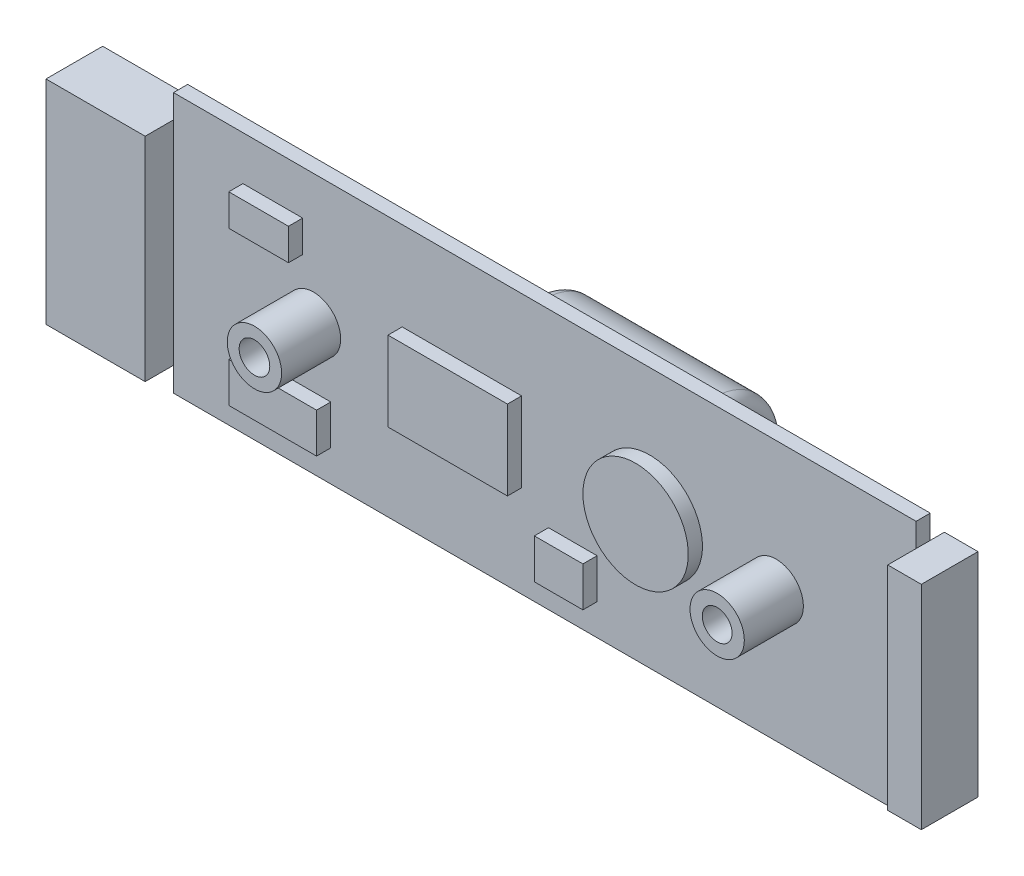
ISO-10303-21;
HEADER;
FILE_DESCRIPTION(('STEP AP214'),'2;1');
FILE_NAME('part.step','',(''),(''),'','','');
FILE_SCHEMA(('AUTOMOTIVE_DESIGN { 1 0 10303 214 1 1 1 1 }'));
ENDSEC;
DATA;
#1=APPLICATION_CONTEXT('core data for automotive mechanical design processes');
#2=APPLICATION_PROTOCOL_DEFINITION('international standard','automotive_design',2000,#1);
#3=PRODUCT_CONTEXT('',#1,'mechanical');
#4=PRODUCT('Part','Part','',(#3));
#5=PRODUCT_RELATED_PRODUCT_CATEGORY('part','',(#4));
#6=PRODUCT_DEFINITION_FORMATION('','',#4);
#7=PRODUCT_DEFINITION_CONTEXT('part definition',#1,'design');
#8=PRODUCT_DEFINITION('design','',#6,#7);
#9=PRODUCT_DEFINITION_SHAPE('','',#8);
#10=(LENGTH_UNIT() NAMED_UNIT(*) SI_UNIT(.MILLI.,.METRE.));
#11=(NAMED_UNIT(*) PLANE_ANGLE_UNIT() SI_UNIT($,.RADIAN.));
#12=(NAMED_UNIT(*) SI_UNIT($,.STERADIAN.) SOLID_ANGLE_UNIT());
#13=UNCERTAINTY_MEASURE_WITH_UNIT(LENGTH_MEASURE(1.E-05),#10,'distance_accuracy_value','');
#14=(GEOMETRIC_REPRESENTATION_CONTEXT(3) GLOBAL_UNCERTAINTY_ASSIGNED_CONTEXT((#13)) GLOBAL_UNIT_ASSIGNED_CONTEXT((#10,
#11,#12)) REPRESENTATION_CONTEXT('',''));
#15=CARTESIAN_POINT('',(0.,0.,0.));
#16=DIRECTION('',(0.,0.,1.));
#17=DIRECTION('',(1.,0.,0.));
#18=AXIS2_PLACEMENT_3D('',#15,#16,#17);
#19=CARTESIAN_POINT('',(-20.828,27.432,-8.1788));
#20=DIRECTION('',(1.,0.,0.));
#21=DIRECTION('',(0.,0.,-1.));
#22=AXIS2_PLACEMENT_3D('',#19,#20,#21);
#23=CYLINDRICAL_SURFACE('',#22,6.36772321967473);
#24=CARTESIAN_POINT('',(-1.27,27.432,-8.1788));
#25=DIRECTION('',(1.,0.,0.));
#26=DIRECTION('',(0.,0.,-1.));
#27=AXIS2_PLACEMENT_3D('',#24,#25,#26);
#28=CIRCLE('',#27,6.36772321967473);
#29=CARTESIAN_POINT('',(-1.27,27.432,-14.5465232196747));
#30=VERTEX_POINT('',#29);
#31=EDGE_CURVE('E11',#30,#30,#28,.F.);
#32=ORIENTED_EDGE('',*,*,#31,.T.);
#33=EDGE_LOOP('',(#32));
#34=FACE_BOUND('',#33,.T.);
#35=CARTESIAN_POINT('',(-19.558,27.432,-8.1788));
#36=DIRECTION('',(1.,0.,0.));
#37=DIRECTION('',(0.,0.,-1.));
#38=AXIS2_PLACEMENT_3D('',#35,#36,#37);
#39=CIRCLE('',#38,6.36772321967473);
#40=CARTESIAN_POINT('',(-19.558,27.432,-14.5465232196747));
#41=VERTEX_POINT('',#40);
#42=EDGE_CURVE('E52',#41,#41,#39,.T.);
#43=ORIENTED_EDGE('',*,*,#42,.T.);
#44=EDGE_LOOP('',(#43));
#45=FACE_BOUND('',#44,.T.);
#46=ADVANCED_FACE('F38',(#34,#45),#23,.T.);
#47=CARTESIAN_POINT('',(-20.828,27.432,-8.1788));
#48=DIRECTION('',(1.,0.,0.));
#49=DIRECTION('',(0.,0.,-1.));
#50=AXIS2_PLACEMENT_3D('',#47,#48,#49);
#51=PLANE('',#50);
#52=CARTESIAN_POINT('',(-20.828,27.432,-8.1788));
#53=DIRECTION('',(1.,0.,0.));
#54=DIRECTION('',(0.,0.,-1.));
#55=AXIS2_PLACEMENT_3D('',#52,#53,#54);
#56=CIRCLE('',#55,5.09772321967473);
#57=CARTESIAN_POINT('',(-20.828,27.432,-13.2765232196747));
#58=VERTEX_POINT('',#57);
#59=EDGE_CURVE('E48',#58,#58,#56,.F.);
#60=ORIENTED_EDGE('',*,*,#59,.T.);
#61=EDGE_LOOP('',(#60));
#62=FACE_BOUND('',#61,.T.);
#63=ADVANCED_FACE('F71',(#62),#51,.F.);
#64=CARTESIAN_POINT('',(0.,27.432,-8.1788));
#65=DIRECTION('',(1.,0.,0.));
#66=DIRECTION('',(0.,0.,-1.));
#67=AXIS2_PLACEMENT_3D('',#64,#65,#66);
#68=PLANE('',#67);
#69=CARTESIAN_POINT('',(0.,27.432,-8.1788));
#70=DIRECTION('',(1.,0.,0.));
#71=DIRECTION('',(0.,0.,-1.));
#72=AXIS2_PLACEMENT_3D('',#69,#70,#71);
#73=CIRCLE('',#72,5.09772321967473);
#74=CARTESIAN_POINT('',(0.,27.432,-13.2765232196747));
#75=VERTEX_POINT('',#74);
#76=EDGE_CURVE('E44',#75,#75,#73,.T.);
#77=ORIENTED_EDGE('',*,*,#76,.T.);
#78=EDGE_LOOP('',(#77));
#79=FACE_BOUND('',#78,.T.);
#80=ADVANCED_FACE('F62',(#79),#68,.T.);
#81=CARTESIAN_POINT('',(-19.558,27.432,-8.1788));
#82=DIRECTION('',(1.,0.,0.));
#83=DIRECTION('',(0.,0.,-1.));
#84=AXIS2_PLACEMENT_3D('',#81,#82,#83);
#85=TOROIDAL_SURFACE('',#84,5.09772321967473,1.27);
#86=ORIENTED_EDGE('',*,*,#59,.F.);
#87=EDGE_LOOP('',(#86));
#88=FACE_BOUND('',#87,.T.);
#89=ORIENTED_EDGE('',*,*,#42,.F.);
#90=EDGE_LOOP('',(#89));
#91=FACE_BOUND('',#90,.T.);
#92=ADVANCED_FACE('F59',(#88,#91),#85,.T.);
#93=CARTESIAN_POINT('',(-1.27,27.432,-8.1788));
#94=DIRECTION('',(1.,0.,0.));
#95=DIRECTION('',(0.,0.,-1.));
#96=AXIS2_PLACEMENT_3D('',#93,#94,#95);
#97=TOROIDAL_SURFACE('',#96,5.09772321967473,1.27);
#98=ORIENTED_EDGE('',*,*,#31,.F.);
#99=EDGE_LOOP('',(#98));
#100=FACE_BOUND('',#99,.T.);
#101=ORIENTED_EDGE('',*,*,#76,.F.);
#102=EDGE_LOOP('',(#101));
#103=FACE_BOUND('',#102,.T.);
#104=ADVANCED_FACE('F61',(#100,#103),#97,.T.);
#105=CLOSED_SHELL('',(#46,#63,#80,#92,#104));
#106=MANIFOLD_SOLID_BREP('B2',#105);
#107=CARTESIAN_POINT('',(13.5977345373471,27.3367954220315,-3.556));
#108=DIRECTION('',(0.,0.,1.));
#109=DIRECTION('',(1.,0.,0.));
#110=AXIS2_PLACEMENT_3D('',#107,#108,#109);
#111=CYLINDRICAL_SURFACE('',#110,2.921);
#112=CARTESIAN_POINT('',(13.5977345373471,27.3367954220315,-2.286));
#113=DIRECTION('',(0.,0.,-1.));
#114=DIRECTION('',(-1.,0.,0.));
#115=AXIS2_PLACEMENT_3D('',#112,#113,#114);
#116=CIRCLE('',#115,2.921);
#117=CARTESIAN_POINT('',(10.6767345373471,27.3367954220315,-2.286));
#118=VERTEX_POINT('',#117);
#119=EDGE_CURVE('E37',#118,#118,#116,.F.);
#120=ORIENTED_EDGE('',*,*,#119,.T.);
#121=EDGE_LOOP('',(#120));
#122=FACE_BOUND('',#121,.T.);
#123=CARTESIAN_POINT('',(13.5977345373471,27.3367954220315,-1.524));
#124=DIRECTION('',(0.,0.,-1.));
#125=DIRECTION('',(-1.,0.,0.));
#126=AXIS2_PLACEMENT_3D('',#123,#124,#125);
#127=CIRCLE('',#126,2.921);
#128=CARTESIAN_POINT('',(10.6767345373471,27.3367954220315,-1.524));
#129=VERTEX_POINT('',#128);
#130=EDGE_CURVE('E129',#129,#129,#127,.T.);
#131=ORIENTED_EDGE('',*,*,#130,.T.);
#132=EDGE_LOOP('',(#131));
#133=FACE_BOUND('',#132,.T.);
#134=ADVANCED_FACE('F119',(#122,#133),#111,.T.);
#135=CARTESIAN_POINT('',(13.5977345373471,27.3367954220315,-3.556));
#136=DIRECTION('',(0.,0.,-1.));
#137=DIRECTION('',(-1.,0.,0.));
#138=AXIS2_PLACEMENT_3D('',#135,#136,#137);
#139=PLANE('',#138);
#140=CARTESIAN_POINT('',(13.5977345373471,27.3367954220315,-3.556));
#141=DIRECTION('',(0.,0.,-1.));
#142=DIRECTION('',(-1.,0.,0.));
#143=AXIS2_PLACEMENT_3D('',#140,#141,#142);
#144=CIRCLE('',#143,1.651);
#145=CARTESIAN_POINT('',(11.9467345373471,27.3367954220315,-3.556));
#146=VERTEX_POINT('',#145);
#147=EDGE_CURVE('E125',#146,#146,#144,.T.);
#148=ORIENTED_EDGE('',*,*,#147,.T.);
#149=EDGE_LOOP('',(#148));
#150=FACE_BOUND('',#149,.T.);
#151=ADVANCED_FACE('F140',(#150),#139,.T.);
#152=CARTESIAN_POINT('',(13.5977345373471,27.3367954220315,-1.524));
#153=DIRECTION('',(0.,0.,-1.));
#154=DIRECTION('',(-1.,0.,0.));
#155=AXIS2_PLACEMENT_3D('',#152,#153,#154);
#156=PLANE('',#155);
#157=ORIENTED_EDGE('',*,*,#130,.F.);
#158=EDGE_LOOP('',(#157));
#159=FACE_BOUND('',#158,.T.);
#160=ADVANCED_FACE('F137',(#159),#156,.F.);
#161=CARTESIAN_POINT('',(13.5977345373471,27.3367954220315,-2.286));
#162=DIRECTION('',(0.,0.,-1.));
#163=DIRECTION('',(-1.,0.,0.));
#164=AXIS2_PLACEMENT_3D('',#161,#162,#163);
#165=TOROIDAL_SURFACE('',#164,1.651,1.27);
#166=ORIENTED_EDGE('',*,*,#119,.F.);
#167=EDGE_LOOP('',(#166));
#168=FACE_BOUND('',#167,.T.);
#169=ORIENTED_EDGE('',*,*,#147,.F.);
#170=EDGE_LOOP('',(#169));
#171=FACE_BOUND('',#170,.T.);
#172=ADVANCED_FACE('F139',(#168,#171),#165,.T.);
#173=CLOSED_SHELL('',(#134,#151,#160,#172));
#174=MANIFOLD_SOLID_BREP('B6',#173);
#175=CARTESIAN_POINT('',(-14.8155040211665,-49.2232959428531,0.));
#176=DIRECTION('',(0.,0.,1.));
#177=DIRECTION('',(1.,0.,0.));
#178=AXIS2_PLACEMENT_3D('',#175,#176,#177);
#179=PLANE('',#178);
#180=DIRECTION('',(1.,0.,0.));
#181=VECTOR('',#180,1.);
#182=CARTESIAN_POINT('',(-10.8863334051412,16.6661752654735,0.));
#183=LINE('',#182,#181);
#184=CARTESIAN_POINT('',(-10.8863334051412,16.6661752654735,0.));
#185=VERTEX_POINT('',#184);
#186=CARTESIAN_POINT('',(-5.66667971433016,16.6661752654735,0.));
#187=VERTEX_POINT('',#186);
#188=EDGE_CURVE('E583',#185,#187,#183,.T.);
#189=ORIENTED_EDGE('',*,*,#188,.F.);
#190=DIRECTION('',(0.,-1.,0.));
#191=VECTOR('',#190,1.);
#192=CARTESIAN_POINT('',(-10.8863334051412,20.9476082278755,0.));
#193=LINE('',#192,#191);
#194=CARTESIAN_POINT('',(-10.8863334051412,20.9476082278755,0.));
#195=VERTEX_POINT('',#194);
#196=EDGE_CURVE('E580',#195,#185,#193,.T.);
#197=ORIENTED_EDGE('',*,*,#196,.F.);
#198=DIRECTION('',(-1.,0.,0.));
#199=VECTOR('',#198,1.);
#200=CARTESIAN_POINT('',(-10.8863334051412,20.9476082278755,0.));
#201=LINE('',#200,#199);
#202=CARTESIAN_POINT('',(-5.66667971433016,20.9476082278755,0.));
#203=VERTEX_POINT('',#202);
#204=EDGE_CURVE('E588',#203,#195,#201,.T.);
#205=ORIENTED_EDGE('',*,*,#204,.F.);
#206=DIRECTION('',(0.,1.,0.));
#207=VECTOR('',#206,1.);
#208=CARTESIAN_POINT('',(-5.66667971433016,20.9476082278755,0.));
#209=LINE('',#208,#207);
#210=EDGE_CURVE('E585',#187,#203,#209,.T.);
#211=ORIENTED_EDGE('',*,*,#210,.F.);
#212=EDGE_LOOP('',(#189,#197,#205,#211));
#213=FACE_BOUND('',#212,.T.);
#214=CARTESIAN_POINT('',(0.,27.4956821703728,0.));
#215=DIRECTION('',(0.,0.,1.));
#216=DIRECTION('',(1.,0.,0.));
#217=AXIS2_PLACEMENT_3D('',#214,#215,#216);
#218=CIRCLE('',#217,5.66667971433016);
#219=CARTESIAN_POINT('',(-5.66667971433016,27.4956821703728,0.));
#220=VERTEX_POINT('',#219);
#221=EDGE_CURVE('E638',#220,#220,#218,.T.);
#222=ORIENTED_EDGE('',*,*,#221,.F.);
#223=EDGE_LOOP('',(#222));
#224=FACE_BOUND('',#223,.T.);
#225=DIRECTION('',(0.,-1.,0.));
#226=VECTOR('',#225,1.);
#227=CARTESIAN_POINT('',(-51.2178826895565,-49.2232959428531,0.));
#228=LINE('',#227,#226);
#229=CARTESIAN_POINT('',(-51.2178826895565,41.3067954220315,0.));
#230=VERTEX_POINT('',#229);
#231=CARTESIAN_POINT('',(-51.2178826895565,38.7667954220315,0.));
#232=VERTEX_POINT('',#231);
#233=EDGE_CURVE('E886',#230,#232,#228,.T.);
#234=ORIENTED_EDGE('',*,*,#233,.T.);
#235=CARTESIAN_POINT('',(-51.2178826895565,15.9067954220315,0.));
#236=VERTEX_POINT('',#235);
#237=EDGE_CURVE('E890',#232,#236,#228,.T.);
#238=ORIENTED_EDGE('',*,*,#237,.T.);
#239=CARTESIAN_POINT('',(-51.2178826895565,13.3067954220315,0.));
#240=VERTEX_POINT('',#239);
#241=EDGE_CURVE('E885',#236,#240,#228,.T.);
#242=ORIENTED_EDGE('',*,*,#241,.T.);
#243=DIRECTION('',(1.,0.,0.));
#244=VECTOR('',#243,1.);
#245=CARTESIAN_POINT('',(-14.8155040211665,13.3067954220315,0.));
#246=LINE('',#245,#244);
#247=CARTESIAN_POINT('',(28.6397173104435,13.3067954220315,0.));
#248=VERTEX_POINT('',#247);
#249=EDGE_CURVE('E889',#240,#248,#246,.T.);
#250=ORIENTED_EDGE('',*,*,#249,.T.);
#251=DIRECTION('',(0.,-1.,0.));
#252=VECTOR('',#251,1.);
#253=CARTESIAN_POINT('',(28.6397173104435,-49.2232959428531,0.));
#254=LINE('',#253,#252);
#255=CARTESIAN_POINT('',(28.6397173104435,15.9067954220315,0.));
#256=VERTEX_POINT('',#255);
#257=EDGE_CURVE('E893',#256,#248,#254,.T.);
#258=ORIENTED_EDGE('',*,*,#257,.F.);
#259=CARTESIAN_POINT('',(28.6397173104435,38.7667954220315,0.));
#260=VERTEX_POINT('',#259);
#261=EDGE_CURVE('E898',#260,#256,#254,.T.);
#262=ORIENTED_EDGE('',*,*,#261,.F.);
#263=CARTESIAN_POINT('',(28.6397173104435,41.3067954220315,0.));
#264=VERTEX_POINT('',#263);
#265=EDGE_CURVE('E894',#264,#260,#254,.T.);
#266=ORIENTED_EDGE('',*,*,#265,.F.);
#267=DIRECTION('',(1.,0.,0.));
#268=VECTOR('',#267,1.);
#269=CARTESIAN_POINT('',(-14.8155040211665,41.3067954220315,0.));
#270=LINE('',#269,#268);
#271=EDGE_CURVE('E897',#230,#264,#270,.T.);
#272=ORIENTED_EDGE('',*,*,#271,.F.);
#273=EDGE_LOOP('',(#234,#238,#242,#250,#258,#262,#266,#272));
#274=FACE_BOUND('',#273,.T.);
#275=CARTESIAN_POINT('',(-36.1629592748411,27.3367954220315,0.));
#276=DIRECTION('',(0.,0.,1.));
#277=DIRECTION('',(1.,0.,0.));
#278=AXIS2_PLACEMENT_3D('',#275,#276,#277);
#279=CIRCLE('',#278,2.921);
#280=CARTESIAN_POINT('',(-33.2419592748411,27.3367954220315,0.));
#281=VERTEX_POINT('',#280);
#282=EDGE_CURVE('E882',#281,#281,#279,.T.);
#283=ORIENTED_EDGE('',*,*,#282,.F.);
#284=EDGE_LOOP('',(#283));
#285=FACE_BOUND('',#284,.T.);
#286=CARTESIAN_POINT('',(13.5977345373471,27.3367954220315,0.));
#287=DIRECTION('',(0.,0.,1.));
#288=DIRECTION('',(1.,0.,0.));
#289=AXIS2_PLACEMENT_3D('',#286,#287,#288);
#290=CIRCLE('',#289,2.921);
#291=CARTESIAN_POINT('',(16.5187345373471,27.3367954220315,0.));
#292=VERTEX_POINT('',#291);
#293=EDGE_CURVE('E879',#292,#292,#290,.T.);
#294=ORIENTED_EDGE('',*,*,#293,.F.);
#295=EDGE_LOOP('',(#294));
#296=FACE_BOUND('',#295,.T.);
#297=DIRECTION('',(1.,0.,0.));
#298=VECTOR('',#297,1.);
#299=CARTESIAN_POINT('',(-26.6268957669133,23.2142492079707,0.));
#300=LINE('',#299,#298);
#301=CARTESIAN_POINT('',(-26.6268957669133,23.2142492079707,0.));
#302=VERTEX_POINT('',#301);
#303=CARTESIAN_POINT('',(-13.7825968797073,23.2142492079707,0.));
#304=VERTEX_POINT('',#303);
#305=EDGE_CURVE('E647',#302,#304,#300,.T.);
#306=ORIENTED_EDGE('',*,*,#305,.F.);
#307=DIRECTION('',(0.,-1.,0.));
#308=VECTOR('',#307,1.);
#309=CARTESIAN_POINT('',(-26.6268957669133,31.7771151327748,0.));
#310=LINE('',#309,#308);
#311=CARTESIAN_POINT('',(-26.6268957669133,31.7771151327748,0.));
#312=VERTEX_POINT('',#311);
#313=EDGE_CURVE('E644',#312,#302,#310,.T.);
#314=ORIENTED_EDGE('',*,*,#313,.F.);
#315=DIRECTION('',(-1.,0.,0.));
#316=VECTOR('',#315,1.);
#317=CARTESIAN_POINT('',(-26.6268957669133,31.7771151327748,0.));
#318=LINE('',#317,#316);
#319=CARTESIAN_POINT('',(-13.7825968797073,31.7771151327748,0.));
#320=VERTEX_POINT('',#319);
#321=EDGE_CURVE('E652',#320,#312,#318,.T.);
#322=ORIENTED_EDGE('',*,*,#321,.F.);
#323=DIRECTION('',(0.,1.,0.));
#324=VECTOR('',#323,1.);
#325=CARTESIAN_POINT('',(-13.7825968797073,31.7771151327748,0.));
#326=LINE('',#325,#324);
#327=EDGE_CURVE('E649',#304,#320,#326,.T.);
#328=ORIENTED_EDGE('',*,*,#327,.F.);
#329=EDGE_LOOP('',(#306,#314,#322,#328));
#330=FACE_BOUND('',#329,.T.);
#331=DIRECTION('',(1.,0.,0.));
#332=VECTOR('',#331,1.);
#333=CARTESIAN_POINT('',(-43.7526276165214,33.1623618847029,0.));
#334=LINE('',#333,#332);
#335=CARTESIAN_POINT('',(-43.7526276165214,33.1623618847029,0.));
#336=VERTEX_POINT('',#335);
#337=CARTESIAN_POINT('',(-37.3304781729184,33.1623618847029,0.));
#338=VERTEX_POINT('',#337);
#339=EDGE_CURVE('E612',#336,#338,#334,.T.);
#340=ORIENTED_EDGE('',*,*,#339,.F.);
#341=DIRECTION('',(0.,-1.,0.));
#342=VECTOR('',#341,1.);
#343=CARTESIAN_POINT('',(-43.7526276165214,36.5622460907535,0.));
#344=LINE('',#343,#342);
#345=CARTESIAN_POINT('',(-43.7526276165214,36.5622460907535,0.));
#346=VERTEX_POINT('',#345);
#347=EDGE_CURVE('E609',#346,#336,#344,.T.);
#348=ORIENTED_EDGE('',*,*,#347,.F.);
#349=DIRECTION('',(-1.,0.,0.));
#350=VECTOR('',#349,1.);
#351=CARTESIAN_POINT('',(-43.7526276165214,36.5622460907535,0.));
#352=LINE('',#351,#350);
#353=CARTESIAN_POINT('',(-37.3304781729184,36.5622460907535,0.));
#354=VERTEX_POINT('',#353);
#355=EDGE_CURVE('E617',#354,#346,#352,.T.);
#356=ORIENTED_EDGE('',*,*,#355,.F.);
#357=DIRECTION('',(0.,1.,0.));
#358=VECTOR('',#357,1.);
#359=CARTESIAN_POINT('',(-37.3304781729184,36.5622460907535,0.));
#360=LINE('',#359,#358);
#361=EDGE_CURVE('E614',#338,#354,#360,.T.);
#362=ORIENTED_EDGE('',*,*,#361,.F.);
#363=EDGE_LOOP('',(#340,#348,#356,#362));
#364=FACE_BOUND('',#363,.T.);
#365=DIRECTION('',(1.,0.,0.));
#366=VECTOR('',#365,1.);
#367=CARTESIAN_POINT('',(-43.7526276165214,16.6661752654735,0.));
#368=LINE('',#367,#366);
#369=CARTESIAN_POINT('',(-43.7526276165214,16.6661752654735,0.));
#370=VERTEX_POINT('',#369);
#371=CARTESIAN_POINT('',(-34.3082901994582,16.6661752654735,0.));
#372=VERTEX_POINT('',#371);
#373=EDGE_CURVE('E556',#370,#372,#368,.T.);
#374=ORIENTED_EDGE('',*,*,#373,.F.);
#375=DIRECTION('',(0.,-1.,0.));
#376=VECTOR('',#375,1.);
#377=CARTESIAN_POINT('',(-43.7526276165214,20.9476082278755,0.));
#378=LINE('',#377,#376);
#379=CARTESIAN_POINT('',(-43.7526276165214,20.9476082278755,0.));
#380=VERTEX_POINT('',#379);
#381=EDGE_CURVE('E551',#380,#370,#378,.T.);
#382=ORIENTED_EDGE('',*,*,#381,.F.);
#383=DIRECTION('',(-1.,0.,0.));
#384=VECTOR('',#383,1.);
#385=CARTESIAN_POINT('',(-43.7526276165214,20.9476082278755,0.));
#386=LINE('',#385,#384);
#387=CARTESIAN_POINT('',(-34.3082901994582,20.9476082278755,0.));
#388=VERTEX_POINT('',#387);
#389=EDGE_CURVE('E560',#388,#380,#386,.T.);
#390=ORIENTED_EDGE('',*,*,#389,.F.);
#391=DIRECTION('',(0.,1.,0.));
#392=VECTOR('',#391,1.);
#393=CARTESIAN_POINT('',(-34.3082901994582,20.9476082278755,0.));
#394=LINE('',#393,#392);
#395=EDGE_CURVE('E558',#372,#388,#394,.T.);
#396=ORIENTED_EDGE('',*,*,#395,.F.);
#397=EDGE_LOOP('',(#374,#382,#390,#396));
#398=FACE_BOUND('',#397,.T.);
#399=ADVANCED_FACE('F183',(#213,#224,#274,#285,#296,#330,#364,#398),#179,.T.);
#400=CARTESIAN_POINT('',(-14.8155040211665,-49.2232959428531,-1.524));
#401=DIRECTION('',(0.,0.,1.));
#402=DIRECTION('',(1.,0.,0.));
#403=AXIS2_PLACEMENT_3D('',#400,#401,#402);
#404=PLANE('',#403);
#405=DIRECTION('',(0.,-1.,0.));
#406=VECTOR('',#405,1.);
#407=CARTESIAN_POINT('',(-24.8639527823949,37.1918685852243,-1.524));
#408=LINE('',#407,#406);
#409=CARTESIAN_POINT('',(-24.8639527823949,37.1918685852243,-1.524));
#410=VERTEX_POINT('',#409);
#411=CARTESIAN_POINT('',(-24.8639527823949,33.6659826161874,-1.524));
#412=VERTEX_POINT('',#411);
#413=EDGE_CURVE('E706',#410,#412,#408,.T.);
#414=ORIENTED_EDGE('',*,*,#413,.F.);
#415=DIRECTION('',(1.,0.,0.));
#416=VECTOR('',#415,1.);
#417=CARTESIAN_POINT('',(-24.8639527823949,37.1918685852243,-1.524));
#418=LINE('',#417,#416);
#419=CARTESIAN_POINT('',(-32.5453472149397,37.1918685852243,-1.524));
#420=VERTEX_POINT('',#419);
#421=EDGE_CURVE('E715',#420,#410,#418,.T.);
#422=ORIENTED_EDGE('',*,*,#421,.F.);
#423=DIRECTION('',(0.,1.,0.));
#424=VECTOR('',#423,1.);
#425=CARTESIAN_POINT('',(-32.5453472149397,37.1918685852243,-1.524));
#426=LINE('',#425,#424);
#427=CARTESIAN_POINT('',(-32.5453472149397,33.6659826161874,-1.524));
#428=VERTEX_POINT('',#427);
#429=EDGE_CURVE('E712',#428,#420,#426,.T.);
#430=ORIENTED_EDGE('',*,*,#429,.F.);
#431=DIRECTION('',(-1.,0.,0.));
#432=VECTOR('',#431,1.);
#433=CARTESIAN_POINT('',(-24.8639527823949,33.6659826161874,-1.524));
#434=LINE('',#433,#432);
#435=EDGE_CURVE('E709',#412,#428,#434,.T.);
#436=ORIENTED_EDGE('',*,*,#435,.F.);
#437=EDGE_LOOP('',(#414,#422,#430,#436));
#438=FACE_BOUND('',#437,.T.);
#439=DIRECTION('',(0.,-1.,0.));
#440=VECTOR('',#439,1.);
#441=CARTESIAN_POINT('',(22.2318098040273,37.1918685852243,-1.524));
#442=LINE('',#441,#440);
#443=CARTESIAN_POINT('',(22.2318098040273,37.1918685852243,-1.524));
#444=VERTEX_POINT('',#443);
#445=CARTESIAN_POINT('',(22.2318098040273,32.2808131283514,-1.524));
#446=VERTEX_POINT('',#445);
#447=EDGE_CURVE('E772',#444,#446,#442,.T.);
#448=ORIENTED_EDGE('',*,*,#447,.F.);
#449=DIRECTION('',(1.,0.,0.));
#450=VECTOR('',#449,1.);
#451=CARTESIAN_POINT('',(22.2318098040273,37.1918685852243,-1.524));
#452=LINE('',#451,#450);
#453=CARTESIAN_POINT('',(15.1800378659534,37.1918685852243,-1.524));
#454=VERTEX_POINT('',#453);
#455=EDGE_CURVE('E781',#454,#444,#452,.T.);
#456=ORIENTED_EDGE('',*,*,#455,.F.);
#457=DIRECTION('',(0.,1.,0.));
#458=VECTOR('',#457,1.);
#459=CARTESIAN_POINT('',(15.1800378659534,37.1918685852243,-1.524));
#460=LINE('',#459,#458);
#461=CARTESIAN_POINT('',(15.1800378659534,32.2808131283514,-1.524));
#462=VERTEX_POINT('',#461);
#463=EDGE_CURVE('E778',#462,#454,#460,.T.);
#464=ORIENTED_EDGE('',*,*,#463,.F.);
#465=DIRECTION('',(-1.,0.,0.));
#466=VECTOR('',#465,1.);
#467=CARTESIAN_POINT('',(22.2318098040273,32.2808131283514,-1.524));
#468=LINE('',#467,#466);
#469=EDGE_CURVE('E775',#446,#462,#468,.T.);
#470=ORIENTED_EDGE('',*,*,#469,.F.);
#471=EDGE_LOOP('',(#448,#456,#464,#470));
#472=FACE_BOUND('',#471,.T.);
#473=DIRECTION('',(0.,-1.,0.));
#474=VECTOR('',#473,1.);
#475=CARTESIAN_POINT('',(-51.2178826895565,-49.2232959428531,-1.524));
#476=LINE('',#475,#474);
#477=CARTESIAN_POINT('',(-51.2178826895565,41.3067954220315,-1.524));
#478=VERTEX_POINT('',#477);
#479=CARTESIAN_POINT('',(-51.2178826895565,38.7667954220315,-1.524));
#480=VERTEX_POINT('',#479);
#481=EDGE_CURVE('E908',#478,#480,#476,.T.);
#482=ORIENTED_EDGE('',*,*,#481,.F.);
#483=DIRECTION('',(1.,0.,0.));
#484=VECTOR('',#483,1.);
#485=CARTESIAN_POINT('',(-14.8155040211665,41.3067954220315,-1.524));
#486=LINE('',#485,#484);
#487=CARTESIAN_POINT('',(28.6397173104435,41.3067954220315,-1.524));
#488=VERTEX_POINT('',#487);
#489=EDGE_CURVE('E918',#478,#488,#486,.T.);
#490=ORIENTED_EDGE('',*,*,#489,.T.);
#491=DIRECTION('',(0.,-1.,0.));
#492=VECTOR('',#491,1.);
#493=CARTESIAN_POINT('',(28.6397173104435,-49.2232959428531,-1.524));
#494=LINE('',#493,#492);
#495=CARTESIAN_POINT('',(28.6397173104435,38.7667954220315,-1.524));
#496=VERTEX_POINT('',#495);
#497=EDGE_CURVE('E915',#488,#496,#494,.T.);
#498=ORIENTED_EDGE('',*,*,#497,.T.);
#499=CARTESIAN_POINT('',(28.6397173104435,15.9067954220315,-1.524));
#500=VERTEX_POINT('',#499);
#501=EDGE_CURVE('E919',#496,#500,#494,.T.);
#502=ORIENTED_EDGE('',*,*,#501,.T.);
#503=CARTESIAN_POINT('',(28.6397173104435,13.3067954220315,-1.524));
#504=VERTEX_POINT('',#503);
#505=EDGE_CURVE('E914',#500,#504,#494,.T.);
#506=ORIENTED_EDGE('',*,*,#505,.T.);
#507=DIRECTION('',(1.,0.,0.));
#508=VECTOR('',#507,1.);
#509=CARTESIAN_POINT('',(-14.8155040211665,13.3067954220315,-1.524));
#510=LINE('',#509,#508);
#511=CARTESIAN_POINT('',(-51.2178826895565,13.3067954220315,-1.524));
#512=VERTEX_POINT('',#511);
#513=EDGE_CURVE('E910',#512,#504,#510,.T.);
#514=ORIENTED_EDGE('',*,*,#513,.F.);
#515=CARTESIAN_POINT('',(-51.2178826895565,15.9067954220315,-1.524));
#516=VERTEX_POINT('',#515);
#517=EDGE_CURVE('E907',#516,#512,#476,.T.);
#518=ORIENTED_EDGE('',*,*,#517,.F.);
#519=EDGE_CURVE('E911',#480,#516,#476,.T.);
#520=ORIENTED_EDGE('',*,*,#519,.F.);
#521=EDGE_LOOP('',(#482,#490,#498,#502,#506,#514,#518,#520));
#522=FACE_BOUND('',#521,.T.);
#523=CARTESIAN_POINT('',(13.5977345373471,27.3367954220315,-1.524));
#524=DIRECTION('',(0.,0.,1.));
#525=DIRECTION('',(1.,0.,0.));
#526=AXIS2_PLACEMENT_3D('',#523,#524,#525);
#527=CIRCLE('',#526,2.921);
#528=CARTESIAN_POINT('',(16.5187345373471,27.3367954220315,-1.524));
#529=VERTEX_POINT('',#528);
#530=EDGE_CURVE('E901',#529,#529,#527,.T.);
#531=ORIENTED_EDGE('',*,*,#530,.T.);
#532=EDGE_LOOP('',(#531));
#533=FACE_BOUND('',#532,.T.);
#534=CARTESIAN_POINT('',(-36.1629592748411,27.3367954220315,-1.524));
#535=DIRECTION('',(0.,0.,1.));
#536=DIRECTION('',(1.,0.,0.));
#537=AXIS2_PLACEMENT_3D('',#534,#535,#536);
#538=CIRCLE('',#537,2.98922572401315);
#539=CARTESIAN_POINT('',(-33.173733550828,27.3367954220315,-1.524));
#540=VERTEX_POINT('',#539);
#541=EDGE_CURVE('E933',#540,#540,#538,.F.);
#542=ORIENTED_EDGE('',*,*,#541,.F.);
#543=EDGE_LOOP('',(#542));
#544=FACE_BOUND('',#543,.T.);
#545=DIRECTION('',(0.,-1.,0.));
#546=VECTOR('',#545,1.);
#547=CARTESIAN_POINT('',(15.1800378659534,21.8290797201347,-1.524));
#548=LINE('',#547,#546);
#549=CARTESIAN_POINT('',(15.1800378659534,21.8290797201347,-1.524));
#550=VERTEX_POINT('',#549);
#551=CARTESIAN_POINT('',(15.1800378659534,16.6661752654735,-1.524));
#552=VERTEX_POINT('',#551);
#553=EDGE_CURVE('E739',#550,#552,#548,.T.);
#554=ORIENTED_EDGE('',*,*,#553,.F.);
#555=DIRECTION('',(1.,0.,0.));
#556=VECTOR('',#555,1.);
#557=CARTESIAN_POINT('',(15.1800378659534,21.8290797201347,-1.524));
#558=LINE('',#557,#556);
#559=CARTESIAN_POINT('',(9.2615864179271,21.8290797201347,-1.524));
#560=VERTEX_POINT('',#559);
#561=EDGE_CURVE('E748',#560,#550,#558,.T.);
#562=ORIENTED_EDGE('',*,*,#561,.F.);
#563=DIRECTION('',(0.,1.,0.));
#564=VECTOR('',#563,1.);
#565=CARTESIAN_POINT('',(9.2615864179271,21.8290797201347,-1.524));
#566=LINE('',#565,#564);
#567=CARTESIAN_POINT('',(9.2615864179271,16.6661752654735,-1.524));
#568=VERTEX_POINT('',#567);
#569=EDGE_CURVE('E745',#568,#560,#566,.T.);
#570=ORIENTED_EDGE('',*,*,#569,.F.);
#571=DIRECTION('',(-1.,0.,0.));
#572=VECTOR('',#571,1.);
#573=CARTESIAN_POINT('',(15.1800378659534,16.6661752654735,-1.524));
#574=LINE('',#573,#572);
#575=EDGE_CURVE('E742',#552,#568,#574,.T.);
#576=ORIENTED_EDGE('',*,*,#575,.F.);
#577=EDGE_LOOP('',(#554,#562,#570,#576));
#578=FACE_BOUND('',#577,.T.);
#579=DIRECTION('',(0.,1.,0.));
#580=VECTOR('',#579,1.);
#581=CARTESIAN_POINT('',(-36.0712331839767,16.6661752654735,-1.524));
#582=LINE('',#581,#580);
#583=CARTESIAN_POINT('',(-36.0712331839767,16.6661752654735,-1.524));
#584=VERTEX_POINT('',#583);
#585=CARTESIAN_POINT('',(-36.0712331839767,20.8216837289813,-1.524));
#586=VERTEX_POINT('',#585);
#587=EDGE_CURVE('E673',#584,#586,#582,.T.);
#588=ORIENTED_EDGE('',*,*,#587,.F.);
#589=DIRECTION('',(-1.,0.,0.));
#590=VECTOR('',#589,1.);
#591=CARTESIAN_POINT('',(-36.0712331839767,16.6661752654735,-1.524));
#592=LINE('',#591,#590);
#593=CARTESIAN_POINT('',(-29.900932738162,16.6661752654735,-1.524));
#594=VERTEX_POINT('',#593);
#595=EDGE_CURVE('E682',#594,#584,#592,.T.);
#596=ORIENTED_EDGE('',*,*,#595,.F.);
#597=DIRECTION('',(0.,-1.,0.));
#598=VECTOR('',#597,1.);
#599=CARTESIAN_POINT('',(-29.900932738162,16.6661752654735,-1.524));
#600=LINE('',#599,#598);
#601=CARTESIAN_POINT('',(-29.900932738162,20.8216837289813,-1.524));
#602=VERTEX_POINT('',#601);
#603=EDGE_CURVE('E679',#602,#594,#600,.T.);
#604=ORIENTED_EDGE('',*,*,#603,.F.);
#605=DIRECTION('',(1.,0.,0.));
#606=VECTOR('',#605,1.);
#607=CARTESIAN_POINT('',(-36.0712331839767,20.8216837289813,-1.524));
#608=LINE('',#607,#606);
#609=EDGE_CURVE('E676',#586,#602,#608,.T.);
#610=ORIENTED_EDGE('',*,*,#609,.F.);
#611=EDGE_LOOP('',(#588,#596,#604,#610));
#612=FACE_BOUND('',#611,.T.);
#613=ADVANCED_FACE('F958',(#438,#472,#522,#533,#544,#578,#612),#404,.F.);
#614=CARTESIAN_POINT('',(28.6397173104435,-49.2232959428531,-1.524));
#615=DIRECTION('',(-1.,0.,0.));
#616=DIRECTION('',(0.,0.,1.));
#617=AXIS2_PLACEMENT_3D('',#614,#615,#616);
#618=PLANE('',#617);
#619=DIRECTION('',(0.,0.,-1.));
#620=VECTOR('',#619,1.);
#621=CARTESIAN_POINT('',(28.6397173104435,15.9067954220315,3.048));
#622=LINE('',#621,#620);
#623=EDGE_CURVE('E833',#256,#500,#622,.T.);
#624=ORIENTED_EDGE('',*,*,#623,.F.);
#625=ORIENTED_EDGE('',*,*,#257,.T.);
#626=DIRECTION('',(0.,0.,1.));
#627=VECTOR('',#626,1.);
#628=CARTESIAN_POINT('',(28.6397173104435,13.3067954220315,-1.524));
#629=LINE('',#628,#627);
#630=EDGE_CURVE('E928',#504,#248,#629,.T.);
#631=ORIENTED_EDGE('',*,*,#630,.F.);
#632=ORIENTED_EDGE('',*,*,#505,.F.);
#633=EDGE_LOOP('',(#624,#625,#631,#632));
#634=FACE_BOUND('',#633,.T.);
#635=ADVANCED_FACE('F964',(#634),#618,.F.);
#636=CARTESIAN_POINT('',(-51.2178826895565,-49.2232959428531,-1.524));
#637=DIRECTION('',(-1.,0.,0.));
#638=DIRECTION('',(0.,0.,1.));
#639=AXIS2_PLACEMENT_3D('',#636,#637,#638);
#640=PLANE('',#639);
#641=ORIENTED_EDGE('',*,*,#241,.F.);
#642=DIRECTION('',(0.,0.,-1.));
#643=VECTOR('',#642,1.);
#644=CARTESIAN_POINT('',(-51.2178826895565,15.9067954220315,3.048));
#645=LINE('',#644,#643);
#646=EDGE_CURVE('E877',#236,#516,#645,.T.);
#647=ORIENTED_EDGE('',*,*,#646,.T.);
#648=ORIENTED_EDGE('',*,*,#517,.T.);
#649=DIRECTION('',(0.,0.,1.));
#650=VECTOR('',#649,1.);
#651=CARTESIAN_POINT('',(-51.2178826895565,13.3067954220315,-1.524));
#652=LINE('',#651,#650);
#653=EDGE_CURVE('E922',#512,#240,#652,.T.);
#654=ORIENTED_EDGE('',*,*,#653,.T.);
#655=EDGE_LOOP('',(#641,#647,#648,#654));
#656=FACE_BOUND('',#655,.T.);
#657=ADVANCED_FACE('F988',(#656),#640,.T.);
#658=DIRECTION('',(0.,0.,-1.));
#659=VECTOR('',#658,1.);
#660=CARTESIAN_POINT('',(-51.2178826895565,38.7667954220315,3.048));
#661=LINE('',#660,#659);
#662=EDGE_CURVE('E872',#232,#480,#661,.T.);
#663=ORIENTED_EDGE('',*,*,#662,.F.);
#664=ORIENTED_EDGE('',*,*,#233,.F.);
#665=DIRECTION('',(0.,0.,1.));
#666=VECTOR('',#665,1.);
#667=CARTESIAN_POINT('',(-51.2178826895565,41.3067954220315,-1.524));
#668=LINE('',#667,#666);
#669=EDGE_CURVE('E923',#478,#230,#668,.T.);
#670=ORIENTED_EDGE('',*,*,#669,.F.);
#671=ORIENTED_EDGE('',*,*,#481,.T.);
#672=EDGE_LOOP('',(#663,#664,#670,#671));
#673=FACE_BOUND('',#672,.T.);
#674=ADVANCED_FACE('F976',(#673),#640,.T.);
#675=CARTESIAN_POINT('',(-14.8155040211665,41.3067954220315,-1.524));
#676=DIRECTION('',(0.,-1.,0.));
#677=DIRECTION('',(0.,0.,-1.));
#678=AXIS2_PLACEMENT_3D('',#675,#676,#677);
#679=PLANE('',#678);
#680=ORIENTED_EDGE('',*,*,#271,.T.);
#681=DIRECTION('',(0.,0.,1.));
#682=VECTOR('',#681,1.);
#683=CARTESIAN_POINT('',(28.6397173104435,41.3067954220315,-1.524));
#684=LINE('',#683,#682);
#685=EDGE_CURVE('E925',#488,#264,#684,.T.);
#686=ORIENTED_EDGE('',*,*,#685,.F.);
#687=ORIENTED_EDGE('',*,*,#489,.F.);
#688=ORIENTED_EDGE('',*,*,#669,.T.);
#689=EDGE_LOOP('',(#680,#686,#687,#688));
#690=FACE_BOUND('',#689,.T.);
#691=ADVANCED_FACE('F972',(#690),#679,.F.);
#692=ORIENTED_EDGE('',*,*,#265,.T.);
#693=DIRECTION('',(0.,0.,-1.));
#694=VECTOR('',#693,1.);
#695=CARTESIAN_POINT('',(28.6397173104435,38.7667954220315,3.048));
#696=LINE('',#695,#694);
#697=EDGE_CURVE('E838',#260,#496,#696,.T.);
#698=ORIENTED_EDGE('',*,*,#697,.T.);
#699=ORIENTED_EDGE('',*,*,#497,.F.);
#700=ORIENTED_EDGE('',*,*,#685,.T.);
#701=EDGE_LOOP('',(#692,#698,#699,#700));
#702=FACE_BOUND('',#701,.T.);
#703=ADVANCED_FACE('F975',(#702),#618,.F.);
#704=CARTESIAN_POINT('',(-36.1629592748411,27.3367954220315,-1.524));
#705=DIRECTION('',(0.,0.,1.));
#706=DIRECTION('',(1.,0.,0.));
#707=AXIS2_PLACEMENT_3D('',#704,#705,#706);
#708=CYLINDRICAL_SURFACE('',#707,2.921);
#709=CARTESIAN_POINT('',(-36.1629592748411,27.3367954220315,-1.524));
#710=DIRECTION('',(0.,0.,1.));
#711=DIRECTION('',(1.,0.,0.));
#712=AXIS2_PLACEMENT_3D('',#709,#710,#711);
#713=CIRCLE('',#712,2.921);
#714=CARTESIAN_POINT('',(-33.2419592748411,27.3367954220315,-1.524));
#715=VERTEX_POINT('',#714);
#716=EDGE_CURVE('E904',#715,#715,#713,.T.);
#717=CARTESIAN_POINT('',(-33.2419592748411,27.3367954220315,-1.524));
#718=CARTESIAN_POINT('',(-33.2419592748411,27.3367954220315,-1.508125));
#719=CARTESIAN_POINT('',(-33.2419592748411,27.3367954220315,-1.49225));
#720=CARTESIAN_POINT('',(-33.2419592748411,27.3367954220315,-1.4605));
#721=CARTESIAN_POINT('',(-33.2419592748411,27.3367954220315,-1.444625));
#722=CARTESIAN_POINT('',(-33.2419592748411,27.3367954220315,-1.412875));
#723=CARTESIAN_POINT('',(-33.2419592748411,27.3367954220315,-1.397));
#724=CARTESIAN_POINT('',(-33.2419592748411,27.3367954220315,-1.36525));
#725=CARTESIAN_POINT('',(-33.2419592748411,27.3367954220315,-1.349375));
#726=CARTESIAN_POINT('',(-33.2419592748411,27.3367954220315,-1.317625));
#727=CARTESIAN_POINT('',(-33.2419592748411,27.3367954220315,-1.30175));
#728=CARTESIAN_POINT('',(-33.2419592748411,27.3367954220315,-1.27));
#729=CARTESIAN_POINT('',(-33.2419592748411,27.3367954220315,-1.254125));
#730=CARTESIAN_POINT('',(-33.2419592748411,27.3367954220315,-1.222375));
#731=CARTESIAN_POINT('',(-33.2419592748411,27.3367954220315,-1.2065));
#732=CARTESIAN_POINT('',(-33.2419592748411,27.3367954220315,-1.17475));
#733=CARTESIAN_POINT('',(-33.2419592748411,27.3367954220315,-1.158875));
#734=CARTESIAN_POINT('',(-33.2419592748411,27.3367954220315,-1.127125));
#735=CARTESIAN_POINT('',(-33.2419592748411,27.3367954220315,-1.11125));
#736=CARTESIAN_POINT('',(-33.2419592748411,27.3367954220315,-1.0795));
#737=CARTESIAN_POINT('',(-33.2419592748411,27.3367954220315,-1.063625));
#738=CARTESIAN_POINT('',(-33.2419592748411,27.3367954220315,-1.031875));
#739=CARTESIAN_POINT('',(-33.2419592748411,27.3367954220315,-1.016));
#740=CARTESIAN_POINT('',(-33.2419592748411,27.3367954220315,-0.98425));
#741=CARTESIAN_POINT('',(-33.2419592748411,27.3367954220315,-0.968375));
#742=CARTESIAN_POINT('',(-33.2419592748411,27.3367954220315,-0.936625));
#743=CARTESIAN_POINT('',(-33.2419592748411,27.3367954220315,-0.92075));
#744=CARTESIAN_POINT('',(-33.2419592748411,27.3367954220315,-0.889));
#745=CARTESIAN_POINT('',(-33.2419592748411,27.3367954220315,-0.873125));
#746=CARTESIAN_POINT('',(-33.2419592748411,27.3367954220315,-0.841375));
#747=CARTESIAN_POINT('',(-33.2419592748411,27.3367954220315,-0.8255));
#748=CARTESIAN_POINT('',(-33.2419592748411,27.3367954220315,-0.79375));
#749=CARTESIAN_POINT('',(-33.2419592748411,27.3367954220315,-0.777875));
#750=CARTESIAN_POINT('',(-33.2419592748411,27.3367954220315,-0.746125));
#751=CARTESIAN_POINT('',(-33.2419592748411,27.3367954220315,-0.73025));
#752=CARTESIAN_POINT('',(-33.2419592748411,27.3367954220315,-0.6985));
#753=CARTESIAN_POINT('',(-33.2419592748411,27.3367954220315,-0.682625));
#754=CARTESIAN_POINT('',(-33.2419592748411,27.3367954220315,-0.650875));
#755=CARTESIAN_POINT('',(-33.2419592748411,27.3367954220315,-0.635));
#756=CARTESIAN_POINT('',(-33.2419592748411,27.3367954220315,-0.60325));
#757=CARTESIAN_POINT('',(-33.2419592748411,27.3367954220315,-0.587375));
#758=CARTESIAN_POINT('',(-33.2419592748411,27.3367954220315,-0.555625));
#759=CARTESIAN_POINT('',(-33.2419592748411,27.3367954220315,-0.53975));
#760=CARTESIAN_POINT('',(-33.2419592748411,27.3367954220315,-0.508));
#761=CARTESIAN_POINT('',(-33.2419592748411,27.3367954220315,-0.492125));
#762=CARTESIAN_POINT('',(-33.2419592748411,27.3367954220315,-0.460375));
#763=CARTESIAN_POINT('',(-33.2419592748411,27.3367954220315,-0.4445));
#764=CARTESIAN_POINT('',(-33.2419592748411,27.3367954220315,-0.41275));
#765=CARTESIAN_POINT('',(-33.2419592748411,27.3367954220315,-0.396875));
#766=CARTESIAN_POINT('',(-33.2419592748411,27.3367954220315,-0.365125));
#767=CARTESIAN_POINT('',(-33.2419592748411,27.3367954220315,-0.34925));
#768=CARTESIAN_POINT('',(-33.2419592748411,27.3367954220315,-0.3175));
#769=CARTESIAN_POINT('',(-33.2419592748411,27.3367954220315,-0.301625));
#770=CARTESIAN_POINT('',(-33.2419592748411,27.3367954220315,-0.269875));
#771=CARTESIAN_POINT('',(-33.2419592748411,27.3367954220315,-0.254));
#772=CARTESIAN_POINT('',(-33.2419592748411,27.3367954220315,-0.22225));
#773=CARTESIAN_POINT('',(-33.2419592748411,27.3367954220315,-0.206375));
#774=CARTESIAN_POINT('',(-33.2419592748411,27.3367954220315,-0.174625));
#775=CARTESIAN_POINT('',(-33.2419592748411,27.3367954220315,-0.15875));
#776=CARTESIAN_POINT('',(-33.2419592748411,27.3367954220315,-0.127));
#777=CARTESIAN_POINT('',(-33.2419592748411,27.3367954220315,-0.111125));
#778=CARTESIAN_POINT('',(-33.2419592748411,27.3367954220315,-0.079375));
#779=CARTESIAN_POINT('',(-33.2419592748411,27.3367954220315,-0.0635));
#780=CARTESIAN_POINT('',(-33.2419592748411,27.3367954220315,-0.0317499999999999));
#781=CARTESIAN_POINT('',(-33.2419592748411,27.3367954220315,-0.015875));
#782=CARTESIAN_POINT('',(-33.2419592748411,27.3367954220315,0.));
#783=B_SPLINE_CURVE_WITH_KNOTS('',3,(#717,#718,#719,#720,#721,#722,#723,#724,#725,#726,#727,
#728,#729,#730,#731,#732,#733,#734,#735,#736,#737,#738,#739,#740,#741,#742,#743,#744,#745,#746,
#747,#748,#749,#750,#751,#752,#753,#754,#755,#756,#757,#758,#759,#760,#761,#762,#763,#764,#765,
#766,#767,#768,#769,#770,#771,#772,#773,#774,#775,#776,#777,#778,#779,#780,#781,#782),
.UNSPECIFIED.,.F.,.F.,(4,2,2,2,2,2,2,2,2,2,2,2,2,2,2,2,2,2,2,2,2,2,2,2,2,2,2,2,2,2,2,2,4),(0.,
0.0476250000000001,0.0952500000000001,0.142875,0.1905,0.238125,0.28575,0.333375,0.381,0.428625,
0.47625,0.523875,0.5715,0.619125,0.66675,0.714375,0.762,0.809625,0.85725,0.904875,0.9525,
1.000125,1.04775,1.095375,1.143,1.190625,1.23825,1.285875,1.3335,1.381125,1.42875,1.476375,
1.524),.UNSPECIFIED.);
#784=EDGE_CURVE('BSEAM980',#715,#281,#783,.T.);
#785=ORIENTED_EDGE('',*,*,#716,.F.);
#786=ORIENTED_EDGE('',*,*,#282,.T.);
#787=ORIENTED_EDGE('',*,*,#784,.T.);
#788=ORIENTED_EDGE('',*,*,#784,.F.);
#789=EDGE_LOOP('',(#785,#787,#786,#788));
#790=FACE_BOUND('',#789,.T.);
#791=ADVANCED_FACE('F980',(#790),#708,.F.);
#792=CARTESIAN_POINT('',(13.5977345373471,27.3367954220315,-1.524));
#793=DIRECTION('',(0.,0.,1.));
#794=DIRECTION('',(1.,0.,0.));
#795=AXIS2_PLACEMENT_3D('',#792,#793,#794);
#796=CYLINDRICAL_SURFACE('',#795,2.921);
#797=CARTESIAN_POINT('',(16.5187345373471,27.3367954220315,-1.524));
#798=CARTESIAN_POINT('',(16.5187345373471,27.3367954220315,-1.508125));
#799=CARTESIAN_POINT('',(16.5187345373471,27.3367954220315,-1.49225));
#800=CARTESIAN_POINT('',(16.5187345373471,27.3367954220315,-1.4605));
#801=CARTESIAN_POINT('',(16.5187345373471,27.3367954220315,-1.444625));
#802=CARTESIAN_POINT('',(16.5187345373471,27.3367954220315,-1.412875));
#803=CARTESIAN_POINT('',(16.5187345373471,27.3367954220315,-1.397));
#804=CARTESIAN_POINT('',(16.5187345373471,27.3367954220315,-1.36525));
#805=CARTESIAN_POINT('',(16.5187345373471,27.3367954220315,-1.349375));
#806=CARTESIAN_POINT('',(16.5187345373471,27.3367954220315,-1.317625));
#807=CARTESIAN_POINT('',(16.5187345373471,27.3367954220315,-1.30175));
#808=CARTESIAN_POINT('',(16.5187345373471,27.3367954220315,-1.27));
#809=CARTESIAN_POINT('',(16.5187345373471,27.3367954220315,-1.254125));
#810=CARTESIAN_POINT('',(16.5187345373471,27.3367954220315,-1.222375));
#811=CARTESIAN_POINT('',(16.5187345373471,27.3367954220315,-1.2065));
#812=CARTESIAN_POINT('',(16.5187345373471,27.3367954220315,-1.17475));
#813=CARTESIAN_POINT('',(16.5187345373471,27.3367954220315,-1.158875));
#814=CARTESIAN_POINT('',(16.5187345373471,27.3367954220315,-1.127125));
#815=CARTESIAN_POINT('',(16.5187345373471,27.3367954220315,-1.11125));
#816=CARTESIAN_POINT('',(16.5187345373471,27.3367954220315,-1.0795));
#817=CARTESIAN_POINT('',(16.5187345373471,27.3367954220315,-1.063625));
#818=CARTESIAN_POINT('',(16.5187345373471,27.3367954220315,-1.031875));
#819=CARTESIAN_POINT('',(16.5187345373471,27.3367954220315,-1.016));
#820=CARTESIAN_POINT('',(16.5187345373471,27.3367954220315,-0.98425));
#821=CARTESIAN_POINT('',(16.5187345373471,27.3367954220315,-0.968375));
#822=CARTESIAN_POINT('',(16.5187345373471,27.3367954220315,-0.936625));
#823=CARTESIAN_POINT('',(16.5187345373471,27.3367954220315,-0.92075));
#824=CARTESIAN_POINT('',(16.5187345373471,27.3367954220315,-0.889));
#825=CARTESIAN_POINT('',(16.5187345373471,27.3367954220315,-0.873125));
#826=CARTESIAN_POINT('',(16.5187345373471,27.3367954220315,-0.841375));
#827=CARTESIAN_POINT('',(16.5187345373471,27.3367954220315,-0.8255));
#828=CARTESIAN_POINT('',(16.5187345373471,27.3367954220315,-0.79375));
#829=CARTESIAN_POINT('',(16.5187345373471,27.3367954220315,-0.777875));
#830=CARTESIAN_POINT('',(16.5187345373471,27.3367954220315,-0.746125));
#831=CARTESIAN_POINT('',(16.5187345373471,27.3367954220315,-0.73025));
#832=CARTESIAN_POINT('',(16.5187345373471,27.3367954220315,-0.6985));
#833=CARTESIAN_POINT('',(16.5187345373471,27.3367954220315,-0.682625));
#834=CARTESIAN_POINT('',(16.5187345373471,27.3367954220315,-0.650875));
#835=CARTESIAN_POINT('',(16.5187345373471,27.3367954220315,-0.635));
#836=CARTESIAN_POINT('',(16.5187345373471,27.3367954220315,-0.60325));
#837=CARTESIAN_POINT('',(16.5187345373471,27.3367954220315,-0.587375));
#838=CARTESIAN_POINT('',(16.5187345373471,27.3367954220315,-0.555625));
#839=CARTESIAN_POINT('',(16.5187345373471,27.3367954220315,-0.53975));
#840=CARTESIAN_POINT('',(16.5187345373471,27.3367954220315,-0.508));
#841=CARTESIAN_POINT('',(16.5187345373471,27.3367954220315,-0.492125));
#842=CARTESIAN_POINT('',(16.5187345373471,27.3367954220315,-0.460375));
#843=CARTESIAN_POINT('',(16.5187345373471,27.3367954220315,-0.4445));
#844=CARTESIAN_POINT('',(16.5187345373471,27.3367954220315,-0.41275));
#845=CARTESIAN_POINT('',(16.5187345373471,27.3367954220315,-0.396875));
#846=CARTESIAN_POINT('',(16.5187345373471,27.3367954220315,-0.365125));
#847=CARTESIAN_POINT('',(16.5187345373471,27.3367954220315,-0.34925));
#848=CARTESIAN_POINT('',(16.5187345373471,27.3367954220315,-0.3175));
#849=CARTESIAN_POINT('',(16.5187345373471,27.3367954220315,-0.301625));
#850=CARTESIAN_POINT('',(16.5187345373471,27.3367954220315,-0.269875));
#851=CARTESIAN_POINT('',(16.5187345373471,27.3367954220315,-0.254));
#852=CARTESIAN_POINT('',(16.5187345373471,27.3367954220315,-0.22225));
#853=CARTESIAN_POINT('',(16.5187345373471,27.3367954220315,-0.206375));
#854=CARTESIAN_POINT('',(16.5187345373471,27.3367954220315,-0.174625));
#855=CARTESIAN_POINT('',(16.5187345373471,27.3367954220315,-0.15875));
#856=CARTESIAN_POINT('',(16.5187345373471,27.3367954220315,-0.127));
#857=CARTESIAN_POINT('',(16.5187345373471,27.3367954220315,-0.111125));
#858=CARTESIAN_POINT('',(16.5187345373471,27.3367954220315,-0.079375));
#859=CARTESIAN_POINT('',(16.5187345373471,27.3367954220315,-0.0635));
#860=CARTESIAN_POINT('',(16.5187345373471,27.3367954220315,-0.0317499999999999));
#861=CARTESIAN_POINT('',(16.5187345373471,27.3367954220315,-0.015875));
#862=CARTESIAN_POINT('',(16.5187345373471,27.3367954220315,0.));
#863=B_SPLINE_CURVE_WITH_KNOTS('',3,(#797,#798,#799,#800,#801,#802,#803,#804,#805,#806,#807,
#808,#809,#810,#811,#812,#813,#814,#815,#816,#817,#818,#819,#820,#821,#822,#823,#824,#825,#826,
#827,#828,#829,#830,#831,#832,#833,#834,#835,#836,#837,#838,#839,#840,#841,#842,#843,#844,#845,
#846,#847,#848,#849,#850,#851,#852,#853,#854,#855,#856,#857,#858,#859,#860,#861,#862),
.UNSPECIFIED.,.F.,.F.,(4,2,2,2,2,2,2,2,2,2,2,2,2,2,2,2,2,2,2,2,2,2,2,2,2,2,2,2,2,2,2,2,4),(0.,
0.0476250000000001,0.0952500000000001,0.142875,0.1905,0.238125,0.28575,0.333375,0.381,0.428625,
0.47625,0.523875,0.5715,0.619125,0.66675,0.714375,0.762,0.809625,0.85725,0.904875,0.9525,
1.000125,1.04775,1.095375,1.143,1.190625,1.23825,1.285875,1.3335,1.381125,1.42875,1.476375,
1.524),.UNSPECIFIED.);
#864=EDGE_CURVE('BSEAM185',#529,#292,#863,.T.);
#865=ORIENTED_EDGE('',*,*,#530,.F.);
#866=ORIENTED_EDGE('',*,*,#293,.T.);
#867=ORIENTED_EDGE('',*,*,#864,.T.);
#868=ORIENTED_EDGE('',*,*,#864,.F.);
#869=EDGE_LOOP('',(#865,#867,#866,#868));
#870=FACE_BOUND('',#869,.T.);
#871=ADVANCED_FACE('F185',(#870),#796,.F.);
#872=CARTESIAN_POINT('',(-14.8155040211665,13.3067954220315,-1.524));
#873=DIRECTION('',(0.,-1.,0.));
#874=DIRECTION('',(0.,0.,-1.));
#875=AXIS2_PLACEMENT_3D('',#872,#873,#874);
#876=PLANE('',#875);
#877=ORIENTED_EDGE('',*,*,#249,.F.);
#878=ORIENTED_EDGE('',*,*,#653,.F.);
#879=ORIENTED_EDGE('',*,*,#513,.T.);
#880=ORIENTED_EDGE('',*,*,#630,.T.);
#881=EDGE_LOOP('',(#877,#878,#879,#880));
#882=FACE_BOUND('',#881,.T.);
#883=ADVANCED_FACE('F982',(#882),#876,.T.);
#884=CARTESIAN_POINT('',(-51.2178826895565,-49.2232959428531,3.048));
#885=DIRECTION('',(1.,0.,0.));
#886=DIRECTION('',(0.,0.,-1.));
#887=AXIS2_PLACEMENT_3D('',#884,#885,#886);
#888=PLANE('',#887);
#889=ORIENTED_EDGE('',*,*,#237,.F.);
#890=CARTESIAN_POINT('',(-51.2178826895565,38.7667954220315,3.048));
#891=VERTEX_POINT('',#890);
#892=EDGE_CURVE('E868',#891,#232,#661,.T.);
#893=ORIENTED_EDGE('',*,*,#892,.F.);
#894=DIRECTION('',(0.,-1.,0.));
#895=VECTOR('',#894,1.);
#896=CARTESIAN_POINT('',(-51.2178826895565,-49.2232959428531,3.048));
#897=LINE('',#896,#895);
#898=CARTESIAN_POINT('',(-51.2178826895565,15.9067954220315,3.048));
#899=VERTEX_POINT('',#898);
#900=EDGE_CURVE('E860',#891,#899,#897,.T.);
#901=ORIENTED_EDGE('',*,*,#900,.T.);
#902=EDGE_CURVE('E873',#899,#236,#645,.T.);
#903=ORIENTED_EDGE('',*,*,#902,.T.);
#904=EDGE_LOOP('',(#889,#893,#901,#903));
#905=FACE_BOUND('',#904,.T.);
#906=ADVANCED_FACE('F985',(#905),#888,.T.);
#907=CARTESIAN_POINT('',(-61.8819635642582,-49.2232959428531,3.048));
#908=DIRECTION('',(-1.,0.,0.));
#909=DIRECTION('',(0.,0.,1.));
#910=AXIS2_PLACEMENT_3D('',#907,#908,#909);
#911=PLANE('',#910);
#912=DIRECTION('',(0.,-1.,0.));
#913=VECTOR('',#912,1.);
#914=CARTESIAN_POINT('',(-61.8819635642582,37.7439278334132,-2.29568650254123));
#915=LINE('',#914,#913);
#916=CARTESIAN_POINT('',(-61.8819635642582,37.7439278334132,-2.29568650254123));
#917=VERTEX_POINT('',#916);
#918=CARTESIAN_POINT('',(-61.8819635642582,17.0476951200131,-2.29568650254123));
#919=VERTEX_POINT('',#918);
#920=EDGE_CURVE('E198',#917,#919,#915,.T.);
#921=ORIENTED_EDGE('',*,*,#920,.F.);
#922=DIRECTION('',(0.,0.,-1.));
#923=VECTOR('',#922,1.);
#924=CARTESIAN_POINT('',(-61.8819635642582,37.7439278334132,-2.29568650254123));
#925=LINE('',#924,#923);
#926=CARTESIAN_POINT('',(-61.8819635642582,37.7439278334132,2.19962425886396));
#927=VERTEX_POINT('',#926);
#928=EDGE_CURVE('E535',#927,#917,#925,.T.);
#929=ORIENTED_EDGE('',*,*,#928,.F.);
#930=DIRECTION('',(0.,1.,0.));
#931=VECTOR('',#930,1.);
#932=CARTESIAN_POINT('',(-61.8819635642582,37.7439278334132,2.19962425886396));
#933=LINE('',#932,#931);
#934=CARTESIAN_POINT('',(-61.8819635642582,17.0476951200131,2.19962425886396));
#935=VERTEX_POINT('',#934);
#936=EDGE_CURVE('E517',#935,#927,#933,.T.);
#937=ORIENTED_EDGE('',*,*,#936,.F.);
#938=DIRECTION('',(0.,0.,1.));
#939=VECTOR('',#938,1.);
#940=CARTESIAN_POINT('',(-61.8819635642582,17.0476951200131,-2.29568650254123));
#941=LINE('',#940,#939);
#942=EDGE_CURVE('E528',#919,#935,#941,.T.);
#943=ORIENTED_EDGE('',*,*,#942,.F.);
#944=EDGE_LOOP('',(#921,#929,#937,#943));
#945=FACE_BOUND('',#944,.T.);
#946=DIRECTION('',(0.,0.,-1.));
#947=VECTOR('',#946,1.);
#948=CARTESIAN_POINT('',(-61.8819635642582,38.7667954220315,3.048));
#949=LINE('',#948,#947);
#950=CARTESIAN_POINT('',(-61.8819635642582,38.7667954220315,3.048));
#951=VERTEX_POINT('',#950);
#952=CARTESIAN_POINT('',(-61.8819635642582,38.7667954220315,-3.048));
#953=VERTEX_POINT('',#952);
#954=EDGE_CURVE('E865',#951,#953,#949,.T.);
#955=ORIENTED_EDGE('',*,*,#954,.T.);
#956=DIRECTION('',(0.,1.,0.));
#957=VECTOR('',#956,1.);
#958=CARTESIAN_POINT('',(-61.8819635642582,-49.2232959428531,-3.048));
#959=LINE('',#958,#957);
#960=CARTESIAN_POINT('',(-61.8819635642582,15.9067954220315,-3.048));
#961=VERTEX_POINT('',#960);
#962=EDGE_CURVE('E842',#961,#953,#959,.T.);
#963=ORIENTED_EDGE('',*,*,#962,.F.);
#964=DIRECTION('',(0.,0.,-1.));
#965=VECTOR('',#964,1.);
#966=CARTESIAN_POINT('',(-61.8819635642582,15.9067954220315,3.048));
#967=LINE('',#966,#965);
#968=CARTESIAN_POINT('',(-61.8819635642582,15.9067954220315,3.048));
#969=VERTEX_POINT('',#968);
#970=EDGE_CURVE('E876',#969,#961,#967,.T.);
#971=ORIENTED_EDGE('',*,*,#970,.F.);
#972=DIRECTION('',(0.,1.,0.));
#973=VECTOR('',#972,1.);
#974=CARTESIAN_POINT('',(-61.8819635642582,-49.2232959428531,3.048));
#975=LINE('',#974,#973);
#976=EDGE_CURVE('E854',#969,#951,#975,.T.);
#977=ORIENTED_EDGE('',*,*,#976,.T.);
#978=EDGE_LOOP('',(#955,#963,#971,#977));
#979=FACE_BOUND('',#978,.T.);
#980=ADVANCED_FACE('F532',(#945,#979),#911,.T.);
#981=CARTESIAN_POINT('',(-14.8155040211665,15.9067954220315,3.048));
#982=DIRECTION('',(0.,-1.,0.));
#983=DIRECTION('',(0.,0.,-1.));
#984=AXIS2_PLACEMENT_3D('',#981,#982,#983);
#985=PLANE('',#984);
#986=ORIENTED_EDGE('',*,*,#970,.T.);
#987=DIRECTION('',(-1.,0.,0.));
#988=VECTOR('',#987,1.);
#989=CARTESIAN_POINT('',(-14.8155040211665,15.9067954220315,-3.048));
#990=LINE('',#989,#988);
#991=CARTESIAN_POINT('',(-51.2178826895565,15.9067954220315,-3.048));
#992=VERTEX_POINT('',#991);
#993=EDGE_CURVE('E845',#992,#961,#990,.T.);
#994=ORIENTED_EDGE('',*,*,#993,.F.);
#995=EDGE_CURVE('E871',#516,#992,#645,.T.);
#996=ORIENTED_EDGE('',*,*,#995,.F.);
#997=ORIENTED_EDGE('',*,*,#646,.F.);
#998=ORIENTED_EDGE('',*,*,#902,.F.);
#999=DIRECTION('',(-1.,0.,0.));
#1000=VECTOR('',#999,1.);
#1001=CARTESIAN_POINT('',(-14.8155040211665,15.9067954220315,3.048));
#1002=LINE('',#1001,#1000);
#1003=EDGE_CURVE('E857',#899,#969,#1002,.T.);
#1004=ORIENTED_EDGE('',*,*,#1003,.T.);
#1005=EDGE_LOOP('',(#986,#994,#996,#997,#998,#1004));
#1006=FACE_BOUND('',#1005,.T.);
#1007=ADVANCED_FACE('F1267',(#1006),#985,.T.);
#1008=CARTESIAN_POINT('',(-51.2178826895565,38.7667954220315,-3.048));
#1009=VERTEX_POINT('',#1008);
#1010=EDGE_CURVE('E867',#480,#1009,#661,.T.);
#1011=ORIENTED_EDGE('',*,*,#1010,.F.);
#1012=ORIENTED_EDGE('',*,*,#519,.T.);
#1013=ORIENTED_EDGE('',*,*,#995,.T.);
#1014=DIRECTION('',(0.,-1.,0.));
#1015=VECTOR('',#1014,1.);
#1016=CARTESIAN_POINT('',(-51.2178826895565,-49.2232959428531,-3.048));
#1017=LINE('',#1016,#1015);
#1018=EDGE_CURVE('E848',#1009,#992,#1017,.T.);
#1019=ORIENTED_EDGE('',*,*,#1018,.F.);
#1020=EDGE_LOOP('',(#1011,#1012,#1013,#1019));
#1021=FACE_BOUND('',#1020,.T.);
#1022=ADVANCED_FACE('F1264',(#1021),#888,.T.);
#1023=CARTESIAN_POINT('',(-14.8155040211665,38.7667954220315,3.048));
#1024=DIRECTION('',(0.,-1.,0.));
#1025=DIRECTION('',(0.,0.,-1.));
#1026=AXIS2_PLACEMENT_3D('',#1023,#1024,#1025);
#1027=PLANE('',#1026);
#1028=ORIENTED_EDGE('',*,*,#892,.T.);
#1029=ORIENTED_EDGE('',*,*,#662,.T.);
#1030=ORIENTED_EDGE('',*,*,#1010,.T.);
#1031=DIRECTION('',(-1.,0.,0.));
#1032=VECTOR('',#1031,1.);
#1033=CARTESIAN_POINT('',(-14.8155040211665,38.7667954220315,-3.048));
#1034=LINE('',#1033,#1032);
#1035=EDGE_CURVE('E851',#1009,#953,#1034,.T.);
#1036=ORIENTED_EDGE('',*,*,#1035,.T.);
#1037=ORIENTED_EDGE('',*,*,#954,.F.);
#1038=DIRECTION('',(-1.,0.,0.));
#1039=VECTOR('',#1038,1.);
#1040=CARTESIAN_POINT('',(-14.8155040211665,38.7667954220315,3.048));
#1041=LINE('',#1040,#1039);
#1042=EDGE_CURVE('E863',#891,#951,#1041,.T.);
#1043=ORIENTED_EDGE('',*,*,#1042,.F.);
#1044=EDGE_LOOP('',(#1028,#1029,#1030,#1036,#1037,#1043));
#1045=FACE_BOUND('',#1044,.T.);
#1046=ADVANCED_FACE('F1260',(#1045),#1027,.F.);
#1047=CARTESIAN_POINT('',(-14.8155040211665,-49.2232959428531,3.048));
#1048=DIRECTION('',(0.,0.,1.));
#1049=DIRECTION('',(1.,0.,0.));
#1050=AXIS2_PLACEMENT_3D('',#1047,#1048,#1049);
#1051=PLANE('',#1050);
#1052=ORIENTED_EDGE('',*,*,#976,.F.);
#1053=ORIENTED_EDGE('',*,*,#1003,.F.);
#1054=ORIENTED_EDGE('',*,*,#900,.F.);
#1055=ORIENTED_EDGE('',*,*,#1042,.T.);
#1056=EDGE_LOOP('',(#1052,#1053,#1054,#1055));
#1057=FACE_BOUND('',#1056,.T.);
#1058=ADVANCED_FACE('F1256',(#1057),#1051,.T.);
#1059=CARTESIAN_POINT('',(-14.8155040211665,-49.2232959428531,-3.048));
#1060=DIRECTION('',(0.,0.,1.));
#1061=DIRECTION('',(1.,0.,0.));
#1062=AXIS2_PLACEMENT_3D('',#1059,#1060,#1061);
#1063=PLANE('',#1062);
#1064=ORIENTED_EDGE('',*,*,#962,.T.);
#1065=ORIENTED_EDGE('',*,*,#1035,.F.);
#1066=ORIENTED_EDGE('',*,*,#1018,.T.);
#1067=ORIENTED_EDGE('',*,*,#993,.T.);
#1068=EDGE_LOOP('',(#1064,#1065,#1066,#1067));
#1069=FACE_BOUND('',#1068,.T.);
#1070=ADVANCED_FACE('F1253',(#1069),#1063,.F.);
#1071=CARTESIAN_POINT('',(28.6397173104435,-49.2232959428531,3.048));
#1072=DIRECTION('',(1.,0.,0.));
#1073=DIRECTION('',(0.,0.,-1.));
#1074=AXIS2_PLACEMENT_3D('',#1071,#1072,#1073);
#1075=PLANE('',#1074);
#1076=CARTESIAN_POINT('',(28.6397173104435,38.7667954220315,3.048));
#1077=VERTEX_POINT('',#1076);
#1078=EDGE_CURVE('E834',#1077,#260,#696,.T.);
#1079=ORIENTED_EDGE('',*,*,#1078,.T.);
#1080=ORIENTED_EDGE('',*,*,#261,.T.);
#1081=CARTESIAN_POINT('',(28.6397173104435,15.9067954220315,3.048));
#1082=VERTEX_POINT('',#1081);
#1083=EDGE_CURVE('E829',#1082,#256,#622,.T.);
#1084=ORIENTED_EDGE('',*,*,#1083,.F.);
#1085=DIRECTION('',(0.,-1.,0.));
#1086=VECTOR('',#1085,1.);
#1087=CARTESIAN_POINT('',(28.6397173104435,-49.2232959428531,3.048));
#1088=LINE('',#1087,#1086);
#1089=EDGE_CURVE('E826',#1077,#1082,#1088,.T.);
#1090=ORIENTED_EDGE('',*,*,#1089,.F.);
#1091=EDGE_LOOP('',(#1079,#1080,#1084,#1090));
#1092=FACE_BOUND('',#1091,.T.);
#1093=ADVANCED_FACE('F1241',(#1092),#1075,.F.);
#1094=CARTESIAN_POINT('',(-14.8155040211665,15.9067954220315,3.048));
#1095=DIRECTION('',(0.,-1.,0.));
#1096=DIRECTION('',(0.,0.,-1.));
#1097=AXIS2_PLACEMENT_3D('',#1094,#1095,#1096);
#1098=PLANE('',#1097);
#1099=ORIENTED_EDGE('',*,*,#1083,.T.);
#1100=ORIENTED_EDGE('',*,*,#623,.T.);
#1101=CARTESIAN_POINT('',(28.6397173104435,15.9067954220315,-3.048));
#1102=VERTEX_POINT('',#1101);
#1103=EDGE_CURVE('E828',#500,#1102,#622,.T.);
#1104=ORIENTED_EDGE('',*,*,#1103,.T.);
#1105=DIRECTION('',(-1.,0.,0.));
#1106=VECTOR('',#1105,1.);
#1107=CARTESIAN_POINT('',(-14.8155040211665,15.9067954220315,-3.048));
#1108=LINE('',#1107,#1106);
#1109=CARTESIAN_POINT('',(32.2509555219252,15.9067954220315,-3.048));
#1110=VERTEX_POINT('',#1109);
#1111=EDGE_CURVE('E805',#1110,#1102,#1108,.T.);
#1112=ORIENTED_EDGE('',*,*,#1111,.F.);
#1113=DIRECTION('',(0.,0.,-1.));
#1114=VECTOR('',#1113,1.);
#1115=CARTESIAN_POINT('',(32.2509555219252,15.9067954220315,3.048));
#1116=LINE('',#1115,#1114);
#1117=CARTESIAN_POINT('',(32.2509555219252,15.9067954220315,3.048));
#1118=VERTEX_POINT('',#1117);
#1119=EDGE_CURVE('E840',#1118,#1110,#1116,.T.);
#1120=ORIENTED_EDGE('',*,*,#1119,.F.);
#1121=DIRECTION('',(-1.,0.,0.));
#1122=VECTOR('',#1121,1.);
#1123=CARTESIAN_POINT('',(-14.8155040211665,15.9067954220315,3.048));
#1124=LINE('',#1123,#1122);
#1125=EDGE_CURVE('E817',#1118,#1082,#1124,.T.);
#1126=ORIENTED_EDGE('',*,*,#1125,.T.);
#1127=EDGE_LOOP('',(#1099,#1100,#1104,#1112,#1120,#1126));
#1128=FACE_BOUND('',#1127,.T.);
#1129=ADVANCED_FACE('F1248',(#1128),#1098,.T.);
#1130=CARTESIAN_POINT('',(32.2509555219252,-49.2232959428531,3.048));
#1131=DIRECTION('',(1.,0.,0.));
#1132=DIRECTION('',(0.,1.,0.));
#1133=AXIS2_PLACEMENT_3D('',#1130,#1131,#1132);
#1134=PLANE('',#1133);
#1135=ORIENTED_EDGE('',*,*,#1119,.T.);
#1136=DIRECTION('',(0.,-1.,0.));
#1137=VECTOR('',#1136,1.);
#1138=CARTESIAN_POINT('',(32.2509555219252,-49.2232959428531,-3.048));
#1139=LINE('',#1138,#1137);
#1140=CARTESIAN_POINT('',(32.2509555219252,38.7667954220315,-3.048));
#1141=VERTEX_POINT('',#1140);
#1142=EDGE_CURVE('E808',#1141,#1110,#1139,.T.);
#1143=ORIENTED_EDGE('',*,*,#1142,.F.);
#1144=DIRECTION('',(0.,0.,-1.));
#1145=VECTOR('',#1144,1.);
#1146=CARTESIAN_POINT('',(32.2509555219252,38.7667954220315,3.048));
#1147=LINE('',#1146,#1145);
#1148=CARTESIAN_POINT('',(32.2509555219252,38.7667954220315,3.048));
#1149=VERTEX_POINT('',#1148);
#1150=EDGE_CURVE('E837',#1149,#1141,#1147,.T.);
#1151=ORIENTED_EDGE('',*,*,#1150,.F.);
#1152=DIRECTION('',(0.,-1.,0.));
#1153=VECTOR('',#1152,1.);
#1154=CARTESIAN_POINT('',(32.2509555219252,-49.2232959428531,3.048));
#1155=LINE('',#1154,#1153);
#1156=EDGE_CURVE('E820',#1149,#1118,#1155,.T.);
#1157=ORIENTED_EDGE('',*,*,#1156,.T.);
#1158=EDGE_LOOP('',(#1135,#1143,#1151,#1157));
#1159=FACE_BOUND('',#1158,.T.);
#1160=ADVANCED_FACE('F1244',(#1159),#1134,.T.);
#1161=CARTESIAN_POINT('',(-14.8155040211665,38.7667954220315,3.048));
#1162=DIRECTION('',(0.,1.,0.));
#1163=DIRECTION('',(0.,0.,1.));
#1164=AXIS2_PLACEMENT_3D('',#1161,#1162,#1163);
#1165=PLANE('',#1164);
#1166=ORIENTED_EDGE('',*,*,#1150,.T.);
#1167=DIRECTION('',(1.,0.,0.));
#1168=VECTOR('',#1167,1.);
#1169=CARTESIAN_POINT('',(-14.8155040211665,38.7667954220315,-3.048));
#1170=LINE('',#1169,#1168);
#1171=CARTESIAN_POINT('',(28.6397173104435,38.7667954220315,-3.048));
#1172=VERTEX_POINT('',#1171);
#1173=EDGE_CURVE('E811',#1172,#1141,#1170,.T.);
#1174=ORIENTED_EDGE('',*,*,#1173,.F.);
#1175=EDGE_CURVE('E832',#496,#1172,#696,.T.);
#1176=ORIENTED_EDGE('',*,*,#1175,.F.);
#1177=ORIENTED_EDGE('',*,*,#697,.F.);
#1178=ORIENTED_EDGE('',*,*,#1078,.F.);
#1179=DIRECTION('',(1.,0.,0.));
#1180=VECTOR('',#1179,1.);
#1181=CARTESIAN_POINT('',(-14.8155040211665,38.7667954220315,3.048));
#1182=LINE('',#1181,#1180);
#1183=EDGE_CURVE('E823',#1077,#1149,#1182,.T.);
#1184=ORIENTED_EDGE('',*,*,#1183,.T.);
#1185=EDGE_LOOP('',(#1166,#1174,#1176,#1177,#1178,#1184));
#1186=FACE_BOUND('',#1185,.T.);
#1187=ADVANCED_FACE('F1239',(#1186),#1165,.T.);
#1188=ORIENTED_EDGE('',*,*,#501,.F.);
#1189=ORIENTED_EDGE('',*,*,#1175,.T.);
#1190=DIRECTION('',(0.,-1.,0.));
#1191=VECTOR('',#1190,1.);
#1192=CARTESIAN_POINT('',(28.6397173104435,-49.2232959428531,-3.048));
#1193=LINE('',#1192,#1191);
#1194=EDGE_CURVE('E814',#1172,#1102,#1193,.T.);
#1195=ORIENTED_EDGE('',*,*,#1194,.T.);
#1196=ORIENTED_EDGE('',*,*,#1103,.F.);
#1197=EDGE_LOOP('',(#1188,#1189,#1195,#1196));
#1198=FACE_BOUND('',#1197,.T.);
#1199=ADVANCED_FACE('F1235',(#1198),#1075,.F.);
#1200=CARTESIAN_POINT('',(-14.8155040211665,-49.2232959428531,3.048));
#1201=DIRECTION('',(0.,0.,1.));
#1202=DIRECTION('',(1.,0.,0.));
#1203=AXIS2_PLACEMENT_3D('',#1200,#1201,#1202);
#1204=PLANE('',#1203);
#1205=ORIENTED_EDGE('',*,*,#1125,.F.);
#1206=ORIENTED_EDGE('',*,*,#1156,.F.);
#1207=ORIENTED_EDGE('',*,*,#1183,.F.);
#1208=ORIENTED_EDGE('',*,*,#1089,.T.);
#1209=EDGE_LOOP('',(#1205,#1206,#1207,#1208));
#1210=FACE_BOUND('',#1209,.T.);
#1211=ADVANCED_FACE('F1231',(#1210),#1204,.T.);
#1212=CARTESIAN_POINT('',(-14.8155040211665,-49.2232959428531,-3.048));
#1213=DIRECTION('',(0.,0.,1.));
#1214=DIRECTION('',(1.,0.,0.));
#1215=AXIS2_PLACEMENT_3D('',#1212,#1213,#1214);
#1216=PLANE('',#1215);
#1217=ORIENTED_EDGE('',*,*,#1111,.T.);
#1218=ORIENTED_EDGE('',*,*,#1194,.F.);
#1219=ORIENTED_EDGE('',*,*,#1173,.T.);
#1220=ORIENTED_EDGE('',*,*,#1142,.T.);
#1221=EDGE_LOOP('',(#1217,#1218,#1219,#1220));
#1222=FACE_BOUND('',#1221,.T.);
#1223=ADVANCED_FACE('F1226',(#1222),#1216,.F.);
#1224=CARTESIAN_POINT('',(-36.1629592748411,27.3367954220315,-3.556));
#1225=DIRECTION('',(0.,0.,-1.));
#1226=DIRECTION('',(-1.,0.,0.));
#1227=AXIS2_PLACEMENT_3D('',#1224,#1225,#1226);
#1228=PLANE('',#1227);
#1229=CARTESIAN_POINT('',(-36.1629592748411,27.3367954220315,-3.556));
#1230=DIRECTION('',(0.,0.,-1.));
#1231=DIRECTION('',(-1.,0.,0.));
#1232=AXIS2_PLACEMENT_3D('',#1229,#1230,#1231);
#1233=CIRCLE('',#1232,1.71922572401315);
#1234=CARTESIAN_POINT('',(-37.8821849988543,27.3367954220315,-3.556));
#1235=VERTEX_POINT('',#1234);
#1236=EDGE_CURVE('E191',#1235,#1235,#1233,.T.);
#1237=ORIENTED_EDGE('',*,*,#1236,.T.);
#1238=EDGE_LOOP('',(#1237));
#1239=FACE_BOUND('',#1238,.T.);
#1240=ADVANCED_FACE('F938',(#1239),#1228,.T.);
#1241=CARTESIAN_POINT('',(-36.1629592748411,27.3367954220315,-3.556));
#1242=DIRECTION('',(0.,0.,1.));
#1243=DIRECTION('',(1.,0.,0.));
#1244=AXIS2_PLACEMENT_3D('',#1241,#1242,#1243);
#1245=CYLINDRICAL_SURFACE('',#1244,2.98922572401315);
#1246=CARTESIAN_POINT('',(-36.1629592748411,27.3367954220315,-2.286));
#1247=DIRECTION('',(0.,0.,-1.));
#1248=DIRECTION('',(-1.,0.,0.));
#1249=AXIS2_PLACEMENT_3D('',#1246,#1247,#1248);
#1250=CIRCLE('',#1249,2.98922572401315);
#1251=CARTESIAN_POINT('',(-39.1521849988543,27.3367954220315,-2.286));
#1252=VERTEX_POINT('',#1251);
#1253=EDGE_CURVE('E117',#1252,#1252,#1250,.F.);
#1254=ORIENTED_EDGE('',*,*,#1253,.T.);
#1255=EDGE_LOOP('',(#1254));
#1256=FACE_BOUND('',#1255,.T.);
#1257=ORIENTED_EDGE('',*,*,#541,.T.);
#1258=EDGE_LOOP('',(#1257));
#1259=FACE_BOUND('',#1258,.T.);
#1260=ADVANCED_FACE('F953',(#1256,#1259),#1245,.T.);
#1261=CARTESIAN_POINT('',(-36.1629592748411,27.3367954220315,-1.524));
#1262=DIRECTION('',(0.,0.,-1.));
#1263=DIRECTION('',(-1.,0.,0.));
#1264=AXIS2_PLACEMENT_3D('',#1261,#1262,#1263);
#1265=PLANE('',#1264);
#1266=ORIENTED_EDGE('',*,*,#716,.T.);
#1267=EDGE_LOOP('',(#1266));
#1268=FACE_BOUND('',#1267,.T.);
#1269=ADVANCED_FACE('F943',(#1268),#1265,.F.);
#1270=CARTESIAN_POINT('',(-36.1629592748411,27.3367954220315,-2.286));
#1271=DIRECTION('',(0.,0.,-1.));
#1272=DIRECTION('',(-1.,0.,0.));
#1273=AXIS2_PLACEMENT_3D('',#1270,#1271,#1272);
#1274=TOROIDAL_SURFACE('',#1273,1.71922572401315,1.27);
#1275=ORIENTED_EDGE('',*,*,#1253,.F.);
#1276=EDGE_LOOP('',(#1275));
#1277=FACE_BOUND('',#1276,.T.);
#1278=ORIENTED_EDGE('',*,*,#1236,.F.);
#1279=EDGE_LOOP('',(#1278));
#1280=FACE_BOUND('',#1279,.T.);
#1281=ADVANCED_FACE('F940',(#1277,#1280),#1274,.T.);
#1282=CARTESIAN_POINT('',(22.2318098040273,37.1918685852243,-3.048));
#1283=DIRECTION('',(-1.,0.,0.));
#1284=DIRECTION('',(0.,0.,1.));
#1285=AXIS2_PLACEMENT_3D('',#1282,#1283,#1284);
#1286=PLANE('',#1285);
#1287=ORIENTED_EDGE('',*,*,#447,.T.);
#1288=DIRECTION('',(0.,0.,1.));
#1289=VECTOR('',#1288,1.);
#1290=CARTESIAN_POINT('',(22.2318098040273,32.2808131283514,-3.048));
#1291=LINE('',#1290,#1289);
#1292=CARTESIAN_POINT('',(22.2318098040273,32.2808131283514,-3.048));
#1293=VERTEX_POINT('',#1292);
#1294=EDGE_CURVE('E802',#1293,#446,#1291,.T.);
#1295=ORIENTED_EDGE('',*,*,#1294,.F.);
#1296=DIRECTION('',(0.,-1.,0.));
#1297=VECTOR('',#1296,1.);
#1298=CARTESIAN_POINT('',(22.2318098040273,37.1918685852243,-3.048));
#1299=LINE('',#1298,#1297);
#1300=CARTESIAN_POINT('',(22.2318098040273,37.1918685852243,-3.048));
#1301=VERTEX_POINT('',#1300);
#1302=EDGE_CURVE('E784',#1301,#1293,#1299,.T.);
#1303=ORIENTED_EDGE('',*,*,#1302,.F.);
#1304=DIRECTION('',(0.,0.,1.));
#1305=VECTOR('',#1304,1.);
#1306=CARTESIAN_POINT('',(22.2318098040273,37.1918685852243,-3.048));
#1307=LINE('',#1306,#1305);
#1308=EDGE_CURVE('E793',#1301,#444,#1307,.T.);
#1309=ORIENTED_EDGE('',*,*,#1308,.T.);
#1310=EDGE_LOOP('',(#1287,#1295,#1303,#1309));
#1311=FACE_BOUND('',#1310,.T.);
#1312=ADVANCED_FACE('F942',(#1311),#1286,.F.);
#1313=CARTESIAN_POINT('',(22.2318098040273,32.2808131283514,-3.048));
#1314=DIRECTION('',(0.,1.,0.));
#1315=DIRECTION('',(0.,0.,1.));
#1316=AXIS2_PLACEMENT_3D('',#1313,#1314,#1315);
#1317=PLANE('',#1316);
#1318=ORIENTED_EDGE('',*,*,#469,.T.);
#1319=DIRECTION('',(0.,0.,1.));
#1320=VECTOR('',#1319,1.);
#1321=CARTESIAN_POINT('',(15.1800378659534,32.2808131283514,-3.048));
#1322=LINE('',#1321,#1320);
#1323=CARTESIAN_POINT('',(15.1800378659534,32.2808131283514,-3.048));
#1324=VERTEX_POINT('',#1323);
#1325=EDGE_CURVE('E799',#1324,#462,#1322,.T.);
#1326=ORIENTED_EDGE('',*,*,#1325,.F.);
#1327=DIRECTION('',(-1.,0.,0.));
#1328=VECTOR('',#1327,1.);
#1329=CARTESIAN_POINT('',(22.2318098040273,32.2808131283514,-3.048));
#1330=LINE('',#1329,#1328);
#1331=EDGE_CURVE('E787',#1293,#1324,#1330,.T.);
#1332=ORIENTED_EDGE('',*,*,#1331,.F.);
#1333=ORIENTED_EDGE('',*,*,#1294,.T.);
#1334=EDGE_LOOP('',(#1318,#1326,#1332,#1333));
#1335=FACE_BOUND('',#1334,.T.);
#1336=ADVANCED_FACE('F950',(#1335),#1317,.F.);
#1337=CARTESIAN_POINT('',(15.1800378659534,37.1918685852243,-3.048));
#1338=DIRECTION('',(1.,0.,0.));
#1339=DIRECTION('',(0.,0.,-1.));
#1340=AXIS2_PLACEMENT_3D('',#1337,#1338,#1339);
#1341=PLANE('',#1340);
#1342=ORIENTED_EDGE('',*,*,#463,.T.);
#1343=DIRECTION('',(0.,0.,1.));
#1344=VECTOR('',#1343,1.);
#1345=CARTESIAN_POINT('',(15.1800378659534,37.1918685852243,-3.048));
#1346=LINE('',#1345,#1344);
#1347=CARTESIAN_POINT('',(15.1800378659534,37.1918685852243,-3.048));
#1348=VERTEX_POINT('',#1347);
#1349=EDGE_CURVE('E796',#1348,#454,#1346,.T.);
#1350=ORIENTED_EDGE('',*,*,#1349,.F.);
#1351=DIRECTION('',(0.,1.,0.));
#1352=VECTOR('',#1351,1.);
#1353=CARTESIAN_POINT('',(15.1800378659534,37.1918685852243,-3.048));
#1354=LINE('',#1353,#1352);
#1355=EDGE_CURVE('E789',#1324,#1348,#1354,.T.);
#1356=ORIENTED_EDGE('',*,*,#1355,.F.);
#1357=ORIENTED_EDGE('',*,*,#1325,.T.);
#1358=EDGE_LOOP('',(#1342,#1350,#1356,#1357));
#1359=FACE_BOUND('',#1358,.T.);
#1360=ADVANCED_FACE('F1179',(#1359),#1341,.F.);
#1361=CARTESIAN_POINT('',(22.2318098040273,37.1918685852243,-3.048));
#1362=DIRECTION('',(0.,-1.,0.));
#1363=DIRECTION('',(0.,0.,-1.));
#1364=AXIS2_PLACEMENT_3D('',#1361,#1362,#1363);
#1365=PLANE('',#1364);
#1366=ORIENTED_EDGE('',*,*,#455,.T.);
#1367=ORIENTED_EDGE('',*,*,#1308,.F.);
#1368=DIRECTION('',(1.,0.,0.));
#1369=VECTOR('',#1368,1.);
#1370=CARTESIAN_POINT('',(22.2318098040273,37.1918685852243,-3.048));
#1371=LINE('',#1370,#1369);
#1372=EDGE_CURVE('E791',#1348,#1301,#1371,.T.);
#1373=ORIENTED_EDGE('',*,*,#1372,.F.);
#1374=ORIENTED_EDGE('',*,*,#1349,.T.);
#1375=EDGE_LOOP('',(#1366,#1367,#1373,#1374));
#1376=FACE_BOUND('',#1375,.T.);
#1377=ADVANCED_FACE('F1175',(#1376),#1365,.F.);
#1378=CARTESIAN_POINT('',(22.2318098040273,32.2808131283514,-3.048));
#1379=DIRECTION('',(0.,0.,-1.));
#1380=DIRECTION('',(-1.,0.,0.));
#1381=AXIS2_PLACEMENT_3D('',#1378,#1379,#1380);
#1382=PLANE('',#1381);
#1383=ORIENTED_EDGE('',*,*,#1302,.T.);
#1384=ORIENTED_EDGE('',*,*,#1331,.T.);
#1385=ORIENTED_EDGE('',*,*,#1355,.T.);
#1386=ORIENTED_EDGE('',*,*,#1372,.T.);
#1387=EDGE_LOOP('',(#1383,#1384,#1385,#1386));
#1388=FACE_BOUND('',#1387,.T.);
#1389=ADVANCED_FACE('F1171',(#1388),#1382,.T.);
#1390=CARTESIAN_POINT('',(15.1800378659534,21.8290797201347,-3.048));
#1391=DIRECTION('',(-1.,0.,0.));
#1392=DIRECTION('',(0.,0.,1.));
#1393=AXIS2_PLACEMENT_3D('',#1390,#1391,#1392);
#1394=PLANE('',#1393);
#1395=ORIENTED_EDGE('',*,*,#553,.T.);
#1396=DIRECTION('',(0.,0.,1.));
#1397=VECTOR('',#1396,1.);
#1398=CARTESIAN_POINT('',(15.1800378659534,16.6661752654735,-3.048));
#1399=LINE('',#1398,#1397);
#1400=CARTESIAN_POINT('',(15.1800378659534,16.6661752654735,-3.048));
#1401=VERTEX_POINT('',#1400);
#1402=EDGE_CURVE('E769',#1401,#552,#1399,.T.);
#1403=ORIENTED_EDGE('',*,*,#1402,.F.);
#1404=DIRECTION('',(0.,-1.,0.));
#1405=VECTOR('',#1404,1.);
#1406=CARTESIAN_POINT('',(15.1800378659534,21.8290797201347,-3.048));
#1407=LINE('',#1406,#1405);
#1408=CARTESIAN_POINT('',(15.1800378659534,21.8290797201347,-3.048));
#1409=VERTEX_POINT('',#1408);
#1410=EDGE_CURVE('E751',#1409,#1401,#1407,.T.);
#1411=ORIENTED_EDGE('',*,*,#1410,.F.);
#1412=DIRECTION('',(0.,0.,1.));
#1413=VECTOR('',#1412,1.);
#1414=CARTESIAN_POINT('',(15.1800378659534,21.8290797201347,-3.048));
#1415=LINE('',#1414,#1413);
#1416=EDGE_CURVE('E760',#1409,#550,#1415,.T.);
#1417=ORIENTED_EDGE('',*,*,#1416,.T.);
#1418=EDGE_LOOP('',(#1395,#1403,#1411,#1417));
#1419=FACE_BOUND('',#1418,.T.);
#1420=ADVANCED_FACE('F1167',(#1419),#1394,.F.);
#1421=CARTESIAN_POINT('',(15.1800378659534,16.6661752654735,-3.048));
#1422=DIRECTION('',(0.,1.,0.));
#1423=DIRECTION('',(0.,0.,1.));
#1424=AXIS2_PLACEMENT_3D('',#1421,#1422,#1423);
#1425=PLANE('',#1424);
#1426=ORIENTED_EDGE('',*,*,#575,.T.);
#1427=DIRECTION('',(0.,0.,1.));
#1428=VECTOR('',#1427,1.);
#1429=CARTESIAN_POINT('',(9.2615864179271,16.6661752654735,-3.048));
#1430=LINE('',#1429,#1428);
#1431=CARTESIAN_POINT('',(9.2615864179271,16.6661752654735,-3.048));
#1432=VERTEX_POINT('',#1431);
#1433=EDGE_CURVE('E766',#1432,#568,#1430,.T.);
#1434=ORIENTED_EDGE('',*,*,#1433,.F.);
#1435=DIRECTION('',(-1.,0.,0.));
#1436=VECTOR('',#1435,1.);
#1437=CARTESIAN_POINT('',(15.1800378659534,16.6661752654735,-3.048));
#1438=LINE('',#1437,#1436);
#1439=EDGE_CURVE('E754',#1401,#1432,#1438,.T.);
#1440=ORIENTED_EDGE('',*,*,#1439,.F.);
#1441=ORIENTED_EDGE('',*,*,#1402,.T.);
#1442=EDGE_LOOP('',(#1426,#1434,#1440,#1441));
#1443=FACE_BOUND('',#1442,.T.);
#1444=ADVANCED_FACE('F1163',(#1443),#1425,.F.);
#1445=CARTESIAN_POINT('',(9.2615864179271,21.8290797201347,-3.048));
#1446=DIRECTION('',(1.,0.,0.));
#1447=DIRECTION('',(0.,0.,-1.));
#1448=AXIS2_PLACEMENT_3D('',#1445,#1446,#1447);
#1449=PLANE('',#1448);
#1450=ORIENTED_EDGE('',*,*,#569,.T.);
#1451=DIRECTION('',(0.,0.,1.));
#1452=VECTOR('',#1451,1.);
#1453=CARTESIAN_POINT('',(9.2615864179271,21.8290797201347,-3.048));
#1454=LINE('',#1453,#1452);
#1455=CARTESIAN_POINT('',(9.2615864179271,21.8290797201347,-3.048));
#1456=VERTEX_POINT('',#1455);
#1457=EDGE_CURVE('E763',#1456,#560,#1454,.T.);
#1458=ORIENTED_EDGE('',*,*,#1457,.F.);
#1459=DIRECTION('',(0.,1.,0.));
#1460=VECTOR('',#1459,1.);
#1461=CARTESIAN_POINT('',(9.2615864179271,21.8290797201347,-3.048));
#1462=LINE('',#1461,#1460);
#1463=EDGE_CURVE('E756',#1432,#1456,#1462,.T.);
#1464=ORIENTED_EDGE('',*,*,#1463,.F.);
#1465=ORIENTED_EDGE('',*,*,#1433,.T.);
#1466=EDGE_LOOP('',(#1450,#1458,#1464,#1465));
#1467=FACE_BOUND('',#1466,.T.);
#1468=ADVANCED_FACE('F1159',(#1467),#1449,.F.);
#1469=CARTESIAN_POINT('',(15.1800378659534,21.8290797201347,-3.048));
#1470=DIRECTION('',(0.,-1.,0.));
#1471=DIRECTION('',(0.,0.,-1.));
#1472=AXIS2_PLACEMENT_3D('',#1469,#1470,#1471);
#1473=PLANE('',#1472);
#1474=ORIENTED_EDGE('',*,*,#561,.T.);
#1475=ORIENTED_EDGE('',*,*,#1416,.F.);
#1476=DIRECTION('',(1.,0.,0.));
#1477=VECTOR('',#1476,1.);
#1478=CARTESIAN_POINT('',(15.1800378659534,21.8290797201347,-3.048));
#1479=LINE('',#1478,#1477);
#1480=EDGE_CURVE('E758',#1456,#1409,#1479,.T.);
#1481=ORIENTED_EDGE('',*,*,#1480,.F.);
#1482=ORIENTED_EDGE('',*,*,#1457,.T.);
#1483=EDGE_LOOP('',(#1474,#1475,#1481,#1482));
#1484=FACE_BOUND('',#1483,.T.);
#1485=ADVANCED_FACE('F1155',(#1484),#1473,.F.);
#1486=CARTESIAN_POINT('',(15.1800378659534,16.6661752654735,-3.048));
#1487=DIRECTION('',(0.,0.,-1.));
#1488=DIRECTION('',(-1.,0.,0.));
#1489=AXIS2_PLACEMENT_3D('',#1486,#1487,#1488);
#1490=PLANE('',#1489);
#1491=ORIENTED_EDGE('',*,*,#1410,.T.);
#1492=ORIENTED_EDGE('',*,*,#1439,.T.);
#1493=ORIENTED_EDGE('',*,*,#1463,.T.);
#1494=ORIENTED_EDGE('',*,*,#1480,.T.);
#1495=EDGE_LOOP('',(#1491,#1492,#1493,#1494));
#1496=FACE_BOUND('',#1495,.T.);
#1497=ADVANCED_FACE('F1151',(#1496),#1490,.T.);
#1498=CARTESIAN_POINT('',(-24.8639527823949,37.1918685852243,-3.048));
#1499=DIRECTION('',(-1.,0.,0.));
#1500=DIRECTION('',(0.,0.,1.));
#1501=AXIS2_PLACEMENT_3D('',#1498,#1499,#1500);
#1502=PLANE('',#1501);
#1503=ORIENTED_EDGE('',*,*,#413,.T.);
#1504=DIRECTION('',(0.,0.,1.));
#1505=VECTOR('',#1504,1.);
#1506=CARTESIAN_POINT('',(-24.8639527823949,33.6659826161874,-3.048));
#1507=LINE('',#1506,#1505);
#1508=CARTESIAN_POINT('',(-24.8639527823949,33.6659826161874,-3.048));
#1509=VERTEX_POINT('',#1508);
#1510=EDGE_CURVE('E736',#1509,#412,#1507,.T.);
#1511=ORIENTED_EDGE('',*,*,#1510,.F.);
#1512=DIRECTION('',(0.,-1.,0.));
#1513=VECTOR('',#1512,1.);
#1514=CARTESIAN_POINT('',(-24.8639527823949,37.1918685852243,-3.048));
#1515=LINE('',#1514,#1513);
#1516=CARTESIAN_POINT('',(-24.8639527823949,37.1918685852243,-3.048));
#1517=VERTEX_POINT('',#1516);
#1518=EDGE_CURVE('E718',#1517,#1509,#1515,.T.);
#1519=ORIENTED_EDGE('',*,*,#1518,.F.);
#1520=DIRECTION('',(0.,0.,1.));
#1521=VECTOR('',#1520,1.);
#1522=CARTESIAN_POINT('',(-24.8639527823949,37.1918685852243,-3.048));
#1523=LINE('',#1522,#1521);
#1524=EDGE_CURVE('E727',#1517,#410,#1523,.T.);
#1525=ORIENTED_EDGE('',*,*,#1524,.T.);
#1526=EDGE_LOOP('',(#1503,#1511,#1519,#1525));
#1527=FACE_BOUND('',#1526,.T.);
#1528=ADVANCED_FACE('F1147',(#1527),#1502,.F.);
#1529=CARTESIAN_POINT('',(-24.8639527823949,33.6659826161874,-3.048));
#1530=DIRECTION('',(0.,1.,0.));
#1531=DIRECTION('',(0.,0.,1.));
#1532=AXIS2_PLACEMENT_3D('',#1529,#1530,#1531);
#1533=PLANE('',#1532);
#1534=ORIENTED_EDGE('',*,*,#435,.T.);
#1535=DIRECTION('',(0.,0.,1.));
#1536=VECTOR('',#1535,1.);
#1537=CARTESIAN_POINT('',(-32.5453472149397,33.6659826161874,-3.048));
#1538=LINE('',#1537,#1536);
#1539=CARTESIAN_POINT('',(-32.5453472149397,33.6659826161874,-3.048));
#1540=VERTEX_POINT('',#1539);
#1541=EDGE_CURVE('E733',#1540,#428,#1538,.T.);
#1542=ORIENTED_EDGE('',*,*,#1541,.F.);
#1543=DIRECTION('',(-1.,0.,0.));
#1544=VECTOR('',#1543,1.);
#1545=CARTESIAN_POINT('',(-24.8639527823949,33.6659826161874,-3.048));
#1546=LINE('',#1545,#1544);
#1547=EDGE_CURVE('E721',#1509,#1540,#1546,.T.);
#1548=ORIENTED_EDGE('',*,*,#1547,.F.);
#1549=ORIENTED_EDGE('',*,*,#1510,.T.);
#1550=EDGE_LOOP('',(#1534,#1542,#1548,#1549));
#1551=FACE_BOUND('',#1550,.T.);
#1552=ADVANCED_FACE('F1143',(#1551),#1533,.F.);
#1553=CARTESIAN_POINT('',(-32.5453472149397,37.1918685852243,-3.048));
#1554=DIRECTION('',(1.,0.,0.));
#1555=DIRECTION('',(0.,0.,-1.));
#1556=AXIS2_PLACEMENT_3D('',#1553,#1554,#1555);
#1557=PLANE('',#1556);
#1558=ORIENTED_EDGE('',*,*,#429,.T.);
#1559=DIRECTION('',(0.,0.,1.));
#1560=VECTOR('',#1559,1.);
#1561=CARTESIAN_POINT('',(-32.5453472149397,37.1918685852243,-3.048));
#1562=LINE('',#1561,#1560);
#1563=CARTESIAN_POINT('',(-32.5453472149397,37.1918685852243,-3.048));
#1564=VERTEX_POINT('',#1563);
#1565=EDGE_CURVE('E730',#1564,#420,#1562,.T.);
#1566=ORIENTED_EDGE('',*,*,#1565,.F.);
#1567=DIRECTION('',(0.,1.,0.));
#1568=VECTOR('',#1567,1.);
#1569=CARTESIAN_POINT('',(-32.5453472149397,37.1918685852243,-3.048));
#1570=LINE('',#1569,#1568);
#1571=EDGE_CURVE('E723',#1540,#1564,#1570,.T.);
#1572=ORIENTED_EDGE('',*,*,#1571,.F.);
#1573=ORIENTED_EDGE('',*,*,#1541,.T.);
#1574=EDGE_LOOP('',(#1558,#1566,#1572,#1573));
#1575=FACE_BOUND('',#1574,.T.);
#1576=ADVANCED_FACE('F1139',(#1575),#1557,.F.);
#1577=CARTESIAN_POINT('',(-24.8639527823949,37.1918685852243,-3.048));
#1578=DIRECTION('',(0.,-1.,0.));
#1579=DIRECTION('',(0.,0.,-1.));
#1580=AXIS2_PLACEMENT_3D('',#1577,#1578,#1579);
#1581=PLANE('',#1580);
#1582=ORIENTED_EDGE('',*,*,#421,.T.);
#1583=ORIENTED_EDGE('',*,*,#1524,.F.);
#1584=DIRECTION('',(1.,0.,0.));
#1585=VECTOR('',#1584,1.);
#1586=CARTESIAN_POINT('',(-24.8639527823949,37.1918685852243,-3.048));
#1587=LINE('',#1586,#1585);
#1588=EDGE_CURVE('E725',#1564,#1517,#1587,.T.);
#1589=ORIENTED_EDGE('',*,*,#1588,.F.);
#1590=ORIENTED_EDGE('',*,*,#1565,.T.);
#1591=EDGE_LOOP('',(#1582,#1583,#1589,#1590));
#1592=FACE_BOUND('',#1591,.T.);
#1593=ADVANCED_FACE('F1135',(#1592),#1581,.F.);
#1594=CARTESIAN_POINT('',(-24.8639527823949,33.6659826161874,-3.048));
#1595=DIRECTION('',(0.,0.,-1.));
#1596=DIRECTION('',(-1.,0.,0.));
#1597=AXIS2_PLACEMENT_3D('',#1594,#1595,#1596);
#1598=PLANE('',#1597);
#1599=ORIENTED_EDGE('',*,*,#1518,.T.);
#1600=ORIENTED_EDGE('',*,*,#1547,.T.);
#1601=ORIENTED_EDGE('',*,*,#1571,.T.);
#1602=ORIENTED_EDGE('',*,*,#1588,.T.);
#1603=EDGE_LOOP('',(#1599,#1600,#1601,#1602));
#1604=FACE_BOUND('',#1603,.T.);
#1605=ADVANCED_FACE('F1131',(#1604),#1598,.T.);
#1606=CARTESIAN_POINT('',(-36.0712331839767,16.6661752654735,-3.048));
#1607=DIRECTION('',(1.,0.,0.));
#1608=DIRECTION('',(0.,0.,-1.));
#1609=AXIS2_PLACEMENT_3D('',#1606,#1607,#1608);
#1610=PLANE('',#1609);
#1611=ORIENTED_EDGE('',*,*,#587,.T.);
#1612=DIRECTION('',(0.,0.,1.));
#1613=VECTOR('',#1612,1.);
#1614=CARTESIAN_POINT('',(-36.0712331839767,20.8216837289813,-3.048));
#1615=LINE('',#1614,#1613);
#1616=CARTESIAN_POINT('',(-36.0712331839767,20.8216837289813,-3.048));
#1617=VERTEX_POINT('',#1616);
#1618=EDGE_CURVE('E703',#1617,#586,#1615,.T.);
#1619=ORIENTED_EDGE('',*,*,#1618,.F.);
#1620=DIRECTION('',(0.,1.,0.));
#1621=VECTOR('',#1620,1.);
#1622=CARTESIAN_POINT('',(-36.0712331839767,16.6661752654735,-3.048));
#1623=LINE('',#1622,#1621);
#1624=CARTESIAN_POINT('',(-36.0712331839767,16.6661752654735,-3.048));
#1625=VERTEX_POINT('',#1624);
#1626=EDGE_CURVE('E685',#1625,#1617,#1623,.T.);
#1627=ORIENTED_EDGE('',*,*,#1626,.F.);
#1628=DIRECTION('',(0.,0.,1.));
#1629=VECTOR('',#1628,1.);
#1630=CARTESIAN_POINT('',(-36.0712331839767,16.6661752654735,-3.048));
#1631=LINE('',#1630,#1629);
#1632=EDGE_CURVE('E694',#1625,#584,#1631,.T.);
#1633=ORIENTED_EDGE('',*,*,#1632,.T.);
#1634=EDGE_LOOP('',(#1611,#1619,#1627,#1633));
#1635=FACE_BOUND('',#1634,.T.);
#1636=ADVANCED_FACE('F1127',(#1635),#1610,.F.);
#1637=CARTESIAN_POINT('',(-36.0712331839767,20.8216837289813,-3.048));
#1638=DIRECTION('',(0.,-1.,0.));
#1639=DIRECTION('',(0.,0.,-1.));
#1640=AXIS2_PLACEMENT_3D('',#1637,#1638,#1639);
#1641=PLANE('',#1640);
#1642=ORIENTED_EDGE('',*,*,#609,.T.);
#1643=DIRECTION('',(0.,0.,1.));
#1644=VECTOR('',#1643,1.);
#1645=CARTESIAN_POINT('',(-29.900932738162,20.8216837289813,-3.048));
#1646=LINE('',#1645,#1644);
#1647=CARTESIAN_POINT('',(-29.900932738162,20.8216837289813,-3.048));
#1648=VERTEX_POINT('',#1647);
#1649=EDGE_CURVE('E700',#1648,#602,#1646,.T.);
#1650=ORIENTED_EDGE('',*,*,#1649,.F.);
#1651=DIRECTION('',(1.,0.,0.));
#1652=VECTOR('',#1651,1.);
#1653=CARTESIAN_POINT('',(-36.0712331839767,20.8216837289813,-3.048));
#1654=LINE('',#1653,#1652);
#1655=EDGE_CURVE('E688',#1617,#1648,#1654,.T.);
#1656=ORIENTED_EDGE('',*,*,#1655,.F.);
#1657=ORIENTED_EDGE('',*,*,#1618,.T.);
#1658=EDGE_LOOP('',(#1642,#1650,#1656,#1657));
#1659=FACE_BOUND('',#1658,.T.);
#1660=ADVANCED_FACE('F1123',(#1659),#1641,.F.);
#1661=CARTESIAN_POINT('',(-29.900932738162,16.6661752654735,-3.048));
#1662=DIRECTION('',(-1.,0.,0.));
#1663=DIRECTION('',(0.,0.,1.));
#1664=AXIS2_PLACEMENT_3D('',#1661,#1662,#1663);
#1665=PLANE('',#1664);
#1666=ORIENTED_EDGE('',*,*,#603,.T.);
#1667=DIRECTION('',(0.,0.,1.));
#1668=VECTOR('',#1667,1.);
#1669=CARTESIAN_POINT('',(-29.900932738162,16.6661752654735,-3.048));
#1670=LINE('',#1669,#1668);
#1671=CARTESIAN_POINT('',(-29.900932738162,16.6661752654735,-3.048));
#1672=VERTEX_POINT('',#1671);
#1673=EDGE_CURVE('E697',#1672,#594,#1670,.T.);
#1674=ORIENTED_EDGE('',*,*,#1673,.F.);
#1675=DIRECTION('',(0.,-1.,0.));
#1676=VECTOR('',#1675,1.);
#1677=CARTESIAN_POINT('',(-29.900932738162,16.6661752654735,-3.048));
#1678=LINE('',#1677,#1676);
#1679=EDGE_CURVE('E690',#1648,#1672,#1678,.T.);
#1680=ORIENTED_EDGE('',*,*,#1679,.F.);
#1681=ORIENTED_EDGE('',*,*,#1649,.T.);
#1682=EDGE_LOOP('',(#1666,#1674,#1680,#1681));
#1683=FACE_BOUND('',#1682,.T.);
#1684=ADVANCED_FACE('F1119',(#1683),#1665,.F.);
#1685=CARTESIAN_POINT('',(-36.0712331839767,16.6661752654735,-3.048));
#1686=DIRECTION('',(0.,1.,0.));
#1687=DIRECTION('',(0.,0.,1.));
#1688=AXIS2_PLACEMENT_3D('',#1685,#1686,#1687);
#1689=PLANE('',#1688);
#1690=ORIENTED_EDGE('',*,*,#595,.T.);
#1691=ORIENTED_EDGE('',*,*,#1632,.F.);
#1692=DIRECTION('',(-1.,0.,0.));
#1693=VECTOR('',#1692,1.);
#1694=CARTESIAN_POINT('',(-36.0712331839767,16.6661752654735,-3.048));
#1695=LINE('',#1694,#1693);
#1696=EDGE_CURVE('E692',#1672,#1625,#1695,.T.);
#1697=ORIENTED_EDGE('',*,*,#1696,.F.);
#1698=ORIENTED_EDGE('',*,*,#1673,.T.);
#1699=EDGE_LOOP('',(#1690,#1691,#1697,#1698));
#1700=FACE_BOUND('',#1699,.T.);
#1701=ADVANCED_FACE('F1115',(#1700),#1689,.F.);
#1702=CARTESIAN_POINT('',(-36.0712331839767,20.8216837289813,-3.048));
#1703=DIRECTION('',(0.,0.,-1.));
#1704=DIRECTION('',(-1.,0.,0.));
#1705=AXIS2_PLACEMENT_3D('',#1702,#1703,#1704);
#1706=PLANE('',#1705);
#1707=ORIENTED_EDGE('',*,*,#1626,.T.);
#1708=ORIENTED_EDGE('',*,*,#1655,.T.);
#1709=ORIENTED_EDGE('',*,*,#1679,.T.);
#1710=ORIENTED_EDGE('',*,*,#1696,.T.);
#1711=EDGE_LOOP('',(#1707,#1708,#1709,#1710));
#1712=FACE_BOUND('',#1711,.T.);
#1713=ADVANCED_FACE('F1111',(#1712),#1706,.T.);
#1714=CARTESIAN_POINT('',(-26.6268957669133,31.7771151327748,1.524));
#1715=DIRECTION('',(1.,0.,0.));
#1716=DIRECTION('',(0.,0.,-1.));
#1717=AXIS2_PLACEMENT_3D('',#1714,#1715,#1716);
#1718=PLANE('',#1717);
#1719=ORIENTED_EDGE('',*,*,#313,.T.);
#1720=DIRECTION('',(0.,0.,-1.));
#1721=VECTOR('',#1720,1.);
#1722=CARTESIAN_POINT('',(-26.6268957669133,23.2142492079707,1.524));
#1723=LINE('',#1722,#1721);
#1724=CARTESIAN_POINT('',(-26.6268957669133,23.2142492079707,1.524));
#1725=VERTEX_POINT('',#1724);
#1726=EDGE_CURVE('E671',#1725,#302,#1723,.T.);
#1727=ORIENTED_EDGE('',*,*,#1726,.F.);
#1728=DIRECTION('',(0.,-1.,0.));
#1729=VECTOR('',#1728,1.);
#1730=CARTESIAN_POINT('',(-26.6268957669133,31.7771151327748,1.524));
#1731=LINE('',#1730,#1729);
#1732=CARTESIAN_POINT('',(-26.6268957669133,31.7771151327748,1.524));
#1733=VERTEX_POINT('',#1732);
#1734=EDGE_CURVE('E654',#1733,#1725,#1731,.T.);
#1735=ORIENTED_EDGE('',*,*,#1734,.F.);
#1736=DIRECTION('',(0.,0.,-1.));
#1737=VECTOR('',#1736,1.);
#1738=CARTESIAN_POINT('',(-26.6268957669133,31.7771151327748,1.524));
#1739=LINE('',#1738,#1737);
#1740=EDGE_CURVE('E663',#1733,#312,#1739,.T.);
#1741=ORIENTED_EDGE('',*,*,#1740,.T.);
#1742=EDGE_LOOP('',(#1719,#1727,#1735,#1741));
#1743=FACE_BOUND('',#1742,.T.);
#1744=ADVANCED_FACE('F1107',(#1743),#1718,.F.);
#1745=CARTESIAN_POINT('',(-26.6268957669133,23.2142492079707,1.524));
#1746=DIRECTION('',(0.,1.,0.));
#1747=DIRECTION('',(0.,0.,1.));
#1748=AXIS2_PLACEMENT_3D('',#1745,#1746,#1747);
#1749=PLANE('',#1748);
#1750=ORIENTED_EDGE('',*,*,#305,.T.);
#1751=DIRECTION('',(0.,0.,-1.));
#1752=VECTOR('',#1751,1.);
#1753=CARTESIAN_POINT('',(-13.7825968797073,23.2142492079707,1.524));
#1754=LINE('',#1753,#1752);
#1755=CARTESIAN_POINT('',(-13.7825968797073,23.2142492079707,1.524));
#1756=VERTEX_POINT('',#1755);
#1757=EDGE_CURVE('E668',#1756,#304,#1754,.T.);
#1758=ORIENTED_EDGE('',*,*,#1757,.F.);
#1759=DIRECTION('',(1.,0.,0.));
#1760=VECTOR('',#1759,1.);
#1761=CARTESIAN_POINT('',(-26.6268957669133,23.2142492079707,1.524));
#1762=LINE('',#1761,#1760);
#1763=EDGE_CURVE('E657',#1725,#1756,#1762,.T.);
#1764=ORIENTED_EDGE('',*,*,#1763,.F.);
#1765=ORIENTED_EDGE('',*,*,#1726,.T.);
#1766=EDGE_LOOP('',(#1750,#1758,#1764,#1765));
#1767=FACE_BOUND('',#1766,.T.);
#1768=ADVANCED_FACE('F1103',(#1767),#1749,.F.);
#1769=CARTESIAN_POINT('',(-13.7825968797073,31.7771151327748,1.524));
#1770=DIRECTION('',(-1.,0.,0.));
#1771=DIRECTION('',(0.,0.,1.));
#1772=AXIS2_PLACEMENT_3D('',#1769,#1770,#1771);
#1773=PLANE('',#1772);
#1774=ORIENTED_EDGE('',*,*,#327,.T.);
#1775=DIRECTION('',(0.,0.,-1.));
#1776=VECTOR('',#1775,1.);
#1777=CARTESIAN_POINT('',(-13.7825968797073,31.7771151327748,1.524));
#1778=LINE('',#1777,#1776);
#1779=CARTESIAN_POINT('',(-13.7825968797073,31.7771151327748,1.524));
#1780=VERTEX_POINT('',#1779);
#1781=EDGE_CURVE('E666',#1780,#320,#1778,.T.);
#1782=ORIENTED_EDGE('',*,*,#1781,.F.);
#1783=DIRECTION('',(0.,1.,0.));
#1784=VECTOR('',#1783,1.);
#1785=CARTESIAN_POINT('',(-13.7825968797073,31.7771151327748,1.524));
#1786=LINE('',#1785,#1784);
#1787=EDGE_CURVE('E659',#1756,#1780,#1786,.T.);
#1788=ORIENTED_EDGE('',*,*,#1787,.F.);
#1789=ORIENTED_EDGE('',*,*,#1757,.T.);
#1790=EDGE_LOOP('',(#1774,#1782,#1788,#1789));
#1791=FACE_BOUND('',#1790,.T.);
#1792=ADVANCED_FACE('F1099',(#1791),#1773,.F.);
#1793=CARTESIAN_POINT('',(-26.6268957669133,31.7771151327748,1.524));
#1794=DIRECTION('',(0.,-1.,0.));
#1795=DIRECTION('',(0.,0.,-1.));
#1796=AXIS2_PLACEMENT_3D('',#1793,#1794,#1795);
#1797=PLANE('',#1796);
#1798=ORIENTED_EDGE('',*,*,#321,.T.);
#1799=ORIENTED_EDGE('',*,*,#1740,.F.);
#1800=DIRECTION('',(-1.,0.,0.));
#1801=VECTOR('',#1800,1.);
#1802=CARTESIAN_POINT('',(-26.6268957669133,31.7771151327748,1.524));
#1803=LINE('',#1802,#1801);
#1804=EDGE_CURVE('E661',#1780,#1733,#1803,.T.);
#1805=ORIENTED_EDGE('',*,*,#1804,.F.);
#1806=ORIENTED_EDGE('',*,*,#1781,.T.);
#1807=EDGE_LOOP('',(#1798,#1799,#1805,#1806));
#1808=FACE_BOUND('',#1807,.T.);
#1809=ADVANCED_FACE('F1095',(#1808),#1797,.F.);
#1810=CARTESIAN_POINT('',(-26.6268957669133,23.2142492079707,1.524));
#1811=DIRECTION('',(0.,0.,1.));
#1812=DIRECTION('',(1.,0.,0.));
#1813=AXIS2_PLACEMENT_3D('',#1810,#1811,#1812);
#1814=PLANE('',#1813);
#1815=ORIENTED_EDGE('',*,*,#1734,.T.);
#1816=ORIENTED_EDGE('',*,*,#1763,.T.);
#1817=ORIENTED_EDGE('',*,*,#1787,.T.);
#1818=ORIENTED_EDGE('',*,*,#1804,.T.);
#1819=EDGE_LOOP('',(#1815,#1816,#1817,#1818));
#1820=FACE_BOUND('',#1819,.T.);
#1821=ADVANCED_FACE('F1091',(#1820),#1814,.T.);
#1822=CARTESIAN_POINT('',(0.,27.4956821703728,1.524));
#1823=DIRECTION('',(0.,0.,-1.));
#1824=DIRECTION('',(-1.,0.,0.));
#1825=AXIS2_PLACEMENT_3D('',#1822,#1823,#1824);
#1826=CYLINDRICAL_SURFACE('',#1825,5.66667971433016);
#1827=CARTESIAN_POINT('',(0.,27.4956821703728,1.524));
#1828=DIRECTION('',(0.,0.,1.));
#1829=DIRECTION('',(1.,0.,0.));
#1830=AXIS2_PLACEMENT_3D('',#1827,#1828,#1829);
#1831=CIRCLE('',#1830,5.66667971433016);
#1832=CARTESIAN_POINT('',(-5.66667971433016,27.4956821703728,1.524));
#1833=VERTEX_POINT('',#1832);
#1834=EDGE_CURVE('E641',#1833,#1833,#1831,.T.);
#1835=CARTESIAN_POINT('',(-5.66667971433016,27.4956821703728,1.524));
#1836=CARTESIAN_POINT('',(-5.66667971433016,27.4956821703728,1.508125));
#1837=CARTESIAN_POINT('',(-5.66667971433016,27.4956821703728,1.49225));
#1838=CARTESIAN_POINT('',(-5.66667971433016,27.4956821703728,1.4605));
#1839=CARTESIAN_POINT('',(-5.66667971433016,27.4956821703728,1.444625));
#1840=CARTESIAN_POINT('',(-5.66667971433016,27.4956821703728,1.412875));
#1841=CARTESIAN_POINT('',(-5.66667971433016,27.4956821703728,1.397));
#1842=CARTESIAN_POINT('',(-5.66667971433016,27.4956821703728,1.36525));
#1843=CARTESIAN_POINT('',(-5.66667971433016,27.4956821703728,1.349375));
#1844=CARTESIAN_POINT('',(-5.66667971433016,27.4956821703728,1.317625));
#1845=CARTESIAN_POINT('',(-5.66667971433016,27.4956821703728,1.30175));
#1846=CARTESIAN_POINT('',(-5.66667971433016,27.4956821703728,1.27));
#1847=CARTESIAN_POINT('',(-5.66667971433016,27.4956821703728,1.254125));
#1848=CARTESIAN_POINT('',(-5.66667971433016,27.4956821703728,1.222375));
#1849=CARTESIAN_POINT('',(-5.66667971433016,27.4956821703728,1.2065));
#1850=CARTESIAN_POINT('',(-5.66667971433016,27.4956821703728,1.17475));
#1851=CARTESIAN_POINT('',(-5.66667971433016,27.4956821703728,1.158875));
#1852=CARTESIAN_POINT('',(-5.66667971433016,27.4956821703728,1.127125));
#1853=CARTESIAN_POINT('',(-5.66667971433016,27.4956821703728,1.11125));
#1854=CARTESIAN_POINT('',(-5.66667971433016,27.4956821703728,1.0795));
#1855=CARTESIAN_POINT('',(-5.66667971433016,27.4956821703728,1.063625));
#1856=CARTESIAN_POINT('',(-5.66667971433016,27.4956821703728,1.031875));
#1857=CARTESIAN_POINT('',(-5.66667971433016,27.4956821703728,1.016));
#1858=CARTESIAN_POINT('',(-5.66667971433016,27.4956821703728,0.98425));
#1859=CARTESIAN_POINT('',(-5.66667971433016,27.4956821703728,0.968375));
#1860=CARTESIAN_POINT('',(-5.66667971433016,27.4956821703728,0.936625));
#1861=CARTESIAN_POINT('',(-5.66667971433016,27.4956821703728,0.92075));
#1862=CARTESIAN_POINT('',(-5.66667971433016,27.4956821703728,0.889));
#1863=CARTESIAN_POINT('',(-5.66667971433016,27.4956821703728,0.873125));
#1864=CARTESIAN_POINT('',(-5.66667971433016,27.4956821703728,0.841375));
#1865=CARTESIAN_POINT('',(-5.66667971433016,27.4956821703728,0.8255));
#1866=CARTESIAN_POINT('',(-5.66667971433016,27.4956821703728,0.79375));
#1867=CARTESIAN_POINT('',(-5.66667971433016,27.4956821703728,0.777875));
#1868=CARTESIAN_POINT('',(-5.66667971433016,27.4956821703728,0.746125));
#1869=CARTESIAN_POINT('',(-5.66667971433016,27.4956821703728,0.73025));
#1870=CARTESIAN_POINT('',(-5.66667971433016,27.4956821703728,0.6985));
#1871=CARTESIAN_POINT('',(-5.66667971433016,27.4956821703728,0.682625));
#1872=CARTESIAN_POINT('',(-5.66667971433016,27.4956821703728,0.650875));
#1873=CARTESIAN_POINT('',(-5.66667971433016,27.4956821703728,0.635));
#1874=CARTESIAN_POINT('',(-5.66667971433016,27.4956821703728,0.60325));
#1875=CARTESIAN_POINT('',(-5.66667971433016,27.4956821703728,0.587375));
#1876=CARTESIAN_POINT('',(-5.66667971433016,27.4956821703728,0.555625));
#1877=CARTESIAN_POINT('',(-5.66667971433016,27.4956821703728,0.53975));
#1878=CARTESIAN_POINT('',(-5.66667971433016,27.4956821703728,0.508));
#1879=CARTESIAN_POINT('',(-5.66667971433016,27.4956821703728,0.492125));
#1880=CARTESIAN_POINT('',(-5.66667971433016,27.4956821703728,0.460375));
#1881=CARTESIAN_POINT('',(-5.66667971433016,27.4956821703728,0.4445));
#1882=CARTESIAN_POINT('',(-5.66667971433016,27.4956821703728,0.41275));
#1883=CARTESIAN_POINT('',(-5.66667971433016,27.4956821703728,0.396875));
#1884=CARTESIAN_POINT('',(-5.66667971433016,27.4956821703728,0.365125));
#1885=CARTESIAN_POINT('',(-5.66667971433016,27.4956821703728,0.34925));
#1886=CARTESIAN_POINT('',(-5.66667971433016,27.4956821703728,0.3175));
#1887=CARTESIAN_POINT('',(-5.66667971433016,27.4956821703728,0.301625));
#1888=CARTESIAN_POINT('',(-5.66667971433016,27.4956821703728,0.269875));
#1889=CARTESIAN_POINT('',(-5.66667971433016,27.4956821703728,0.254));
#1890=CARTESIAN_POINT('',(-5.66667971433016,27.4956821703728,0.22225));
#1891=CARTESIAN_POINT('',(-5.66667971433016,27.4956821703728,0.206375));
#1892=CARTESIAN_POINT('',(-5.66667971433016,27.4956821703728,0.174625));
#1893=CARTESIAN_POINT('',(-5.66667971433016,27.4956821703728,0.15875));
#1894=CARTESIAN_POINT('',(-5.66667971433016,27.4956821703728,0.127));
#1895=CARTESIAN_POINT('',(-5.66667971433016,27.4956821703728,0.111125));
#1896=CARTESIAN_POINT('',(-5.66667971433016,27.4956821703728,0.079375));
#1897=CARTESIAN_POINT('',(-5.66667971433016,27.4956821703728,0.0635));
#1898=CARTESIAN_POINT('',(-5.66667971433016,27.4956821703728,0.0317499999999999));
#1899=CARTESIAN_POINT('',(-5.66667971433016,27.4956821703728,0.015875));
#1900=CARTESIAN_POINT('',(-5.66667971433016,27.4956821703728,0.));
#1901=B_SPLINE_CURVE_WITH_KNOTS('',3,(#1835,#1836,#1837,#1838,#1839,#1840,#1841,#1842,#1843,
#1844,#1845,#1846,#1847,#1848,#1849,#1850,#1851,#1852,#1853,#1854,#1855,#1856,#1857,#1858,#1859,
#1860,#1861,#1862,#1863,#1864,#1865,#1866,#1867,#1868,#1869,#1870,#1871,#1872,#1873,#1874,#1875,
#1876,#1877,#1878,#1879,#1880,#1881,#1882,#1883,#1884,#1885,#1886,#1887,#1888,#1889,#1890,#1891,
#1892,#1893,#1894,#1895,#1896,#1897,#1898,#1899,#1900),.UNSPECIFIED.,.F.,.F.,(4,2,2,2,2,2,2,2,2,
2,2,2,2,2,2,2,2,2,2,2,2,2,2,2,2,2,2,2,2,2,2,2,4),(0.,0.0476250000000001,0.0952500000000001,
0.142875,0.1905,0.238125,0.28575,0.333375,0.381,0.428625,0.47625,0.523875,0.5715,0.619125,
0.66675,0.714375,0.762,0.809625,0.85725,0.904875,0.9525,1.000125,1.04775,1.095375,1.143,
1.190625,1.23825,1.285875,1.3335,1.381125,1.42875,1.476375,1.524),.UNSPECIFIED.);
#1902=EDGE_CURVE('BSEAM1087',#1833,#220,#1901,.T.);
#1903=ORIENTED_EDGE('',*,*,#1834,.F.);
#1904=ORIENTED_EDGE('',*,*,#221,.T.);
#1905=ORIENTED_EDGE('',*,*,#1902,.T.);
#1906=ORIENTED_EDGE('',*,*,#1902,.F.);
#1907=EDGE_LOOP('',(#1903,#1905,#1904,#1906));
#1908=FACE_BOUND('',#1907,.T.);
#1909=ADVANCED_FACE('F1087',(#1908),#1826,.T.);
#1910=CARTESIAN_POINT('',(0.,27.4956821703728,1.524));
#1911=DIRECTION('',(0.,0.,1.));
#1912=DIRECTION('',(1.,0.,0.));
#1913=AXIS2_PLACEMENT_3D('',#1910,#1911,#1912);
#1914=PLANE('',#1913);
#1915=ORIENTED_EDGE('',*,*,#1834,.T.);
#1916=EDGE_LOOP('',(#1915));
#1917=FACE_BOUND('',#1916,.T.);
#1918=ADVANCED_FACE('F1083',(#1917),#1914,.T.);
#1919=CARTESIAN_POINT('',(-43.7526276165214,36.5622460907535,1.524));
#1920=DIRECTION('',(1.,0.,0.));
#1921=DIRECTION('',(0.,0.,-1.));
#1922=AXIS2_PLACEMENT_3D('',#1919,#1920,#1921);
#1923=PLANE('',#1922);
#1924=ORIENTED_EDGE('',*,*,#347,.T.);
#1925=DIRECTION('',(0.,0.,-1.));
#1926=VECTOR('',#1925,1.);
#1927=CARTESIAN_POINT('',(-43.7526276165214,33.1623618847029,1.524));
#1928=LINE('',#1927,#1926);
#1929=CARTESIAN_POINT('',(-43.7526276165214,33.1623618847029,1.524));
#1930=VERTEX_POINT('',#1929);
#1931=EDGE_CURVE('E636',#1930,#336,#1928,.T.);
#1932=ORIENTED_EDGE('',*,*,#1931,.F.);
#1933=DIRECTION('',(0.,-1.,0.));
#1934=VECTOR('',#1933,1.);
#1935=CARTESIAN_POINT('',(-43.7526276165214,36.5622460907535,1.524));
#1936=LINE('',#1935,#1934);
#1937=CARTESIAN_POINT('',(-43.7526276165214,36.5622460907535,1.524));
#1938=VERTEX_POINT('',#1937);
#1939=EDGE_CURVE('E619',#1938,#1930,#1936,.T.);
#1940=ORIENTED_EDGE('',*,*,#1939,.F.);
#1941=DIRECTION('',(0.,0.,-1.));
#1942=VECTOR('',#1941,1.);
#1943=CARTESIAN_POINT('',(-43.7526276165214,36.5622460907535,1.524));
#1944=LINE('',#1943,#1942);
#1945=EDGE_CURVE('E628',#1938,#346,#1944,.T.);
#1946=ORIENTED_EDGE('',*,*,#1945,.T.);
#1947=EDGE_LOOP('',(#1924,#1932,#1940,#1946));
#1948=FACE_BOUND('',#1947,.T.);
#1949=ADVANCED_FACE('F1079',(#1948),#1923,.F.);
#1950=CARTESIAN_POINT('',(-43.7526276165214,33.1623618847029,1.524));
#1951=DIRECTION('',(0.,1.,0.));
#1952=DIRECTION('',(0.,0.,1.));
#1953=AXIS2_PLACEMENT_3D('',#1950,#1951,#1952);
#1954=PLANE('',#1953);
#1955=ORIENTED_EDGE('',*,*,#339,.T.);
#1956=DIRECTION('',(0.,0.,-1.));
#1957=VECTOR('',#1956,1.);
#1958=CARTESIAN_POINT('',(-37.3304781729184,33.1623618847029,1.524));
#1959=LINE('',#1958,#1957);
#1960=CARTESIAN_POINT('',(-37.3304781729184,33.1623618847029,1.524));
#1961=VERTEX_POINT('',#1960);
#1962=EDGE_CURVE('E633',#1961,#338,#1959,.T.);
#1963=ORIENTED_EDGE('',*,*,#1962,.F.);
#1964=DIRECTION('',(1.,0.,0.));
#1965=VECTOR('',#1964,1.);
#1966=CARTESIAN_POINT('',(-43.7526276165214,33.1623618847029,1.524));
#1967=LINE('',#1966,#1965);
#1968=EDGE_CURVE('E622',#1930,#1961,#1967,.T.);
#1969=ORIENTED_EDGE('',*,*,#1968,.F.);
#1970=ORIENTED_EDGE('',*,*,#1931,.T.);
#1971=EDGE_LOOP('',(#1955,#1963,#1969,#1970));
#1972=FACE_BOUND('',#1971,.T.);
#1973=ADVANCED_FACE('F1075',(#1972),#1954,.F.);
#1974=CARTESIAN_POINT('',(-37.3304781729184,36.5622460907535,1.524));
#1975=DIRECTION('',(-1.,0.,0.));
#1976=DIRECTION('',(0.,0.,1.));
#1977=AXIS2_PLACEMENT_3D('',#1974,#1975,#1976);
#1978=PLANE('',#1977);
#1979=ORIENTED_EDGE('',*,*,#361,.T.);
#1980=DIRECTION('',(0.,0.,-1.));
#1981=VECTOR('',#1980,1.);
#1982=CARTESIAN_POINT('',(-37.3304781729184,36.5622460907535,1.524));
#1983=LINE('',#1982,#1981);
#1984=CARTESIAN_POINT('',(-37.3304781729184,36.5622460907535,1.524));
#1985=VERTEX_POINT('',#1984);
#1986=EDGE_CURVE('E631',#1985,#354,#1983,.T.);
#1987=ORIENTED_EDGE('',*,*,#1986,.F.);
#1988=DIRECTION('',(0.,1.,0.));
#1989=VECTOR('',#1988,1.);
#1990=CARTESIAN_POINT('',(-37.3304781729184,36.5622460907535,1.524));
#1991=LINE('',#1990,#1989);
#1992=EDGE_CURVE('E624',#1961,#1985,#1991,.T.);
#1993=ORIENTED_EDGE('',*,*,#1992,.F.);
#1994=ORIENTED_EDGE('',*,*,#1962,.T.);
#1995=EDGE_LOOP('',(#1979,#1987,#1993,#1994));
#1996=FACE_BOUND('',#1995,.T.);
#1997=ADVANCED_FACE('F1071',(#1996),#1978,.F.);
#1998=CARTESIAN_POINT('',(-43.7526276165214,36.5622460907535,1.524));
#1999=DIRECTION('',(0.,-1.,0.));
#2000=DIRECTION('',(0.,0.,-1.));
#2001=AXIS2_PLACEMENT_3D('',#1998,#1999,#2000);
#2002=PLANE('',#2001);
#2003=ORIENTED_EDGE('',*,*,#355,.T.);
#2004=ORIENTED_EDGE('',*,*,#1945,.F.);
#2005=DIRECTION('',(-1.,0.,0.));
#2006=VECTOR('',#2005,1.);
#2007=CARTESIAN_POINT('',(-43.7526276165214,36.5622460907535,1.524));
#2008=LINE('',#2007,#2006);
#2009=EDGE_CURVE('E626',#1985,#1938,#2008,.T.);
#2010=ORIENTED_EDGE('',*,*,#2009,.F.);
#2011=ORIENTED_EDGE('',*,*,#1986,.T.);
#2012=EDGE_LOOP('',(#2003,#2004,#2010,#2011));
#2013=FACE_BOUND('',#2012,.T.);
#2014=ADVANCED_FACE('F1067',(#2013),#2002,.F.);
#2015=CARTESIAN_POINT('',(-43.7526276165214,33.1623618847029,1.524));
#2016=DIRECTION('',(0.,0.,1.));
#2017=DIRECTION('',(1.,0.,0.));
#2018=AXIS2_PLACEMENT_3D('',#2015,#2016,#2017);
#2019=PLANE('',#2018);
#2020=ORIENTED_EDGE('',*,*,#1939,.T.);
#2021=ORIENTED_EDGE('',*,*,#1968,.T.);
#2022=ORIENTED_EDGE('',*,*,#1992,.T.);
#2023=ORIENTED_EDGE('',*,*,#2009,.T.);
#2024=EDGE_LOOP('',(#2020,#2021,#2022,#2023));
#2025=FACE_BOUND('',#2024,.T.);
#2026=ADVANCED_FACE('F1063',(#2025),#2019,.T.);
#2027=CARTESIAN_POINT('',(-10.8863334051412,20.9476082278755,1.524));
#2028=DIRECTION('',(1.,0.,0.));
#2029=DIRECTION('',(0.,0.,-1.));
#2030=AXIS2_PLACEMENT_3D('',#2027,#2028,#2029);
#2031=PLANE('',#2030);
#2032=ORIENTED_EDGE('',*,*,#196,.T.);
#2033=DIRECTION('',(0.,0.,-1.));
#2034=VECTOR('',#2033,1.);
#2035=CARTESIAN_POINT('',(-10.8863334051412,16.6661752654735,1.524));
#2036=LINE('',#2035,#2034);
#2037=CARTESIAN_POINT('',(-10.8863334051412,16.6661752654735,1.524));
#2038=VERTEX_POINT('',#2037);
#2039=EDGE_CURVE('E607',#2038,#185,#2036,.T.);
#2040=ORIENTED_EDGE('',*,*,#2039,.F.);
#2041=DIRECTION('',(0.,-1.,0.));
#2042=VECTOR('',#2041,1.);
#2043=CARTESIAN_POINT('',(-10.8863334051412,20.9476082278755,1.524));
#2044=LINE('',#2043,#2042);
#2045=CARTESIAN_POINT('',(-10.8863334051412,20.9476082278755,1.524));
#2046=VERTEX_POINT('',#2045);
#2047=EDGE_CURVE('E590',#2046,#2038,#2044,.T.);
#2048=ORIENTED_EDGE('',*,*,#2047,.F.);
#2049=DIRECTION('',(0.,0.,-1.));
#2050=VECTOR('',#2049,1.);
#2051=CARTESIAN_POINT('',(-10.8863334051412,20.9476082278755,1.524));
#2052=LINE('',#2051,#2050);
#2053=EDGE_CURVE('E599',#2046,#195,#2052,.T.);
#2054=ORIENTED_EDGE('',*,*,#2053,.T.);
#2055=EDGE_LOOP('',(#2032,#2040,#2048,#2054));
#2056=FACE_BOUND('',#2055,.T.);
#2057=ADVANCED_FACE('F1059',(#2056),#2031,.F.);
#2058=CARTESIAN_POINT('',(-10.8863334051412,16.6661752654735,1.524));
#2059=DIRECTION('',(0.,1.,0.));
#2060=DIRECTION('',(0.,0.,1.));
#2061=AXIS2_PLACEMENT_3D('',#2058,#2059,#2060);
#2062=PLANE('',#2061);
#2063=ORIENTED_EDGE('',*,*,#188,.T.);
#2064=DIRECTION('',(0.,0.,-1.));
#2065=VECTOR('',#2064,1.);
#2066=CARTESIAN_POINT('',(-5.66667971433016,16.6661752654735,1.524));
#2067=LINE('',#2066,#2065);
#2068=CARTESIAN_POINT('',(-5.66667971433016,16.6661752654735,1.524));
#2069=VERTEX_POINT('',#2068);
#2070=EDGE_CURVE('E604',#2069,#187,#2067,.T.);
#2071=ORIENTED_EDGE('',*,*,#2070,.F.);
#2072=DIRECTION('',(1.,0.,0.));
#2073=VECTOR('',#2072,1.);
#2074=CARTESIAN_POINT('',(-10.8863334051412,16.6661752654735,1.524));
#2075=LINE('',#2074,#2073);
#2076=EDGE_CURVE('E593',#2038,#2069,#2075,.T.);
#2077=ORIENTED_EDGE('',*,*,#2076,.F.);
#2078=ORIENTED_EDGE('',*,*,#2039,.T.);
#2079=EDGE_LOOP('',(#2063,#2071,#2077,#2078));
#2080=FACE_BOUND('',#2079,.T.);
#2081=ADVANCED_FACE('F1055',(#2080),#2062,.F.);
#2082=CARTESIAN_POINT('',(-5.66667971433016,20.9476082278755,1.524));
#2083=DIRECTION('',(-1.,0.,0.));
#2084=DIRECTION('',(0.,0.,1.));
#2085=AXIS2_PLACEMENT_3D('',#2082,#2083,#2084);
#2086=PLANE('',#2085);
#2087=ORIENTED_EDGE('',*,*,#210,.T.);
#2088=DIRECTION('',(0.,0.,-1.));
#2089=VECTOR('',#2088,1.);
#2090=CARTESIAN_POINT('',(-5.66667971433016,20.9476082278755,1.524));
#2091=LINE('',#2090,#2089);
#2092=CARTESIAN_POINT('',(-5.66667971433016,20.9476082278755,1.524));
#2093=VERTEX_POINT('',#2092);
#2094=EDGE_CURVE('E602',#2093,#203,#2091,.T.);
#2095=ORIENTED_EDGE('',*,*,#2094,.F.);
#2096=DIRECTION('',(0.,1.,0.));
#2097=VECTOR('',#2096,1.);
#2098=CARTESIAN_POINT('',(-5.66667971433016,20.9476082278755,1.524));
#2099=LINE('',#2098,#2097);
#2100=EDGE_CURVE('E595',#2069,#2093,#2099,.T.);
#2101=ORIENTED_EDGE('',*,*,#2100,.F.);
#2102=ORIENTED_EDGE('',*,*,#2070,.T.);
#2103=EDGE_LOOP('',(#2087,#2095,#2101,#2102));
#2104=FACE_BOUND('',#2103,.T.);
#2105=ADVANCED_FACE('F1051',(#2104),#2086,.F.);
#2106=CARTESIAN_POINT('',(-10.8863334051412,20.9476082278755,1.524));
#2107=DIRECTION('',(0.,-1.,0.));
#2108=DIRECTION('',(0.,0.,-1.));
#2109=AXIS2_PLACEMENT_3D('',#2106,#2107,#2108);
#2110=PLANE('',#2109);
#2111=ORIENTED_EDGE('',*,*,#204,.T.);
#2112=ORIENTED_EDGE('',*,*,#2053,.F.);
#2113=DIRECTION('',(-1.,0.,0.));
#2114=VECTOR('',#2113,1.);
#2115=CARTESIAN_POINT('',(-10.8863334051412,20.9476082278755,1.524));
#2116=LINE('',#2115,#2114);
#2117=EDGE_CURVE('E597',#2093,#2046,#2116,.T.);
#2118=ORIENTED_EDGE('',*,*,#2117,.F.);
#2119=ORIENTED_EDGE('',*,*,#2094,.T.);
#2120=EDGE_LOOP('',(#2111,#2112,#2118,#2119));
#2121=FACE_BOUND('',#2120,.T.);
#2122=ADVANCED_FACE('F1047',(#2121),#2110,.F.);
#2123=CARTESIAN_POINT('',(-10.8863334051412,16.6661752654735,1.524));
#2124=DIRECTION('',(0.,0.,1.));
#2125=DIRECTION('',(1.,0.,0.));
#2126=AXIS2_PLACEMENT_3D('',#2123,#2124,#2125);
#2127=PLANE('',#2126);
#2128=ORIENTED_EDGE('',*,*,#2047,.T.);
#2129=ORIENTED_EDGE('',*,*,#2076,.T.);
#2130=ORIENTED_EDGE('',*,*,#2100,.T.);
#2131=ORIENTED_EDGE('',*,*,#2117,.T.);
#2132=EDGE_LOOP('',(#2128,#2129,#2130,#2131));
#2133=FACE_BOUND('',#2132,.T.);
#2134=ADVANCED_FACE('F1044',(#2133),#2127,.T.);
#2135=CARTESIAN_POINT('',(-43.7526276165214,20.9476082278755,1.524));
#2136=DIRECTION('',(1.,0.,0.));
#2137=DIRECTION('',(0.,0.,-1.));
#2138=AXIS2_PLACEMENT_3D('',#2135,#2136,#2137);
#2139=PLANE('',#2138);
#2140=ORIENTED_EDGE('',*,*,#381,.T.);
#2141=DIRECTION('',(0.,0.,-1.));
#2142=VECTOR('',#2141,1.);
#2143=CARTESIAN_POINT('',(-43.7526276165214,16.6661752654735,1.524));
#2144=LINE('',#2143,#2142);
#2145=CARTESIAN_POINT('',(-43.7526276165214,16.6661752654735,1.524));
#2146=VERTEX_POINT('',#2145);
#2147=EDGE_CURVE('E578',#2146,#370,#2144,.T.);
#2148=ORIENTED_EDGE('',*,*,#2147,.F.);
#2149=DIRECTION('',(0.,-1.,0.));
#2150=VECTOR('',#2149,1.);
#2151=CARTESIAN_POINT('',(-43.7526276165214,20.9476082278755,1.524));
#2152=LINE('',#2151,#2150);
#2153=CARTESIAN_POINT('',(-43.7526276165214,20.9476082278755,1.524));
#2154=VERTEX_POINT('',#2153);
#2155=EDGE_CURVE('E562',#2154,#2146,#2152,.T.);
#2156=ORIENTED_EDGE('',*,*,#2155,.F.);
#2157=DIRECTION('',(0.,0.,-1.));
#2158=VECTOR('',#2157,1.);
#2159=CARTESIAN_POINT('',(-43.7526276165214,20.9476082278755,1.524));
#2160=LINE('',#2159,#2158);
#2161=EDGE_CURVE('E571',#2154,#380,#2160,.T.);
#2162=ORIENTED_EDGE('',*,*,#2161,.T.);
#2163=EDGE_LOOP('',(#2140,#2148,#2156,#2162));
#2164=FACE_BOUND('',#2163,.T.);
#2165=ADVANCED_FACE('F1027',(#2164),#2139,.F.);
#2166=CARTESIAN_POINT('',(-43.7526276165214,16.6661752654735,1.524));
#2167=DIRECTION('',(0.,1.,0.));
#2168=DIRECTION('',(0.,0.,1.));
#2169=AXIS2_PLACEMENT_3D('',#2166,#2167,#2168);
#2170=PLANE('',#2169);
#2171=ORIENTED_EDGE('',*,*,#373,.T.);
#2172=DIRECTION('',(0.,0.,-1.));
#2173=VECTOR('',#2172,1.);
#2174=CARTESIAN_POINT('',(-34.3082901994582,16.6661752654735,1.524));
#2175=LINE('',#2174,#2173);
#2176=CARTESIAN_POINT('',(-34.3082901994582,16.6661752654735,1.524));
#2177=VERTEX_POINT('',#2176);
#2178=EDGE_CURVE('E575',#2177,#372,#2175,.T.);
#2179=ORIENTED_EDGE('',*,*,#2178,.F.);
#2180=DIRECTION('',(1.,0.,0.));
#2181=VECTOR('',#2180,1.);
#2182=CARTESIAN_POINT('',(-43.7526276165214,16.6661752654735,1.524));
#2183=LINE('',#2182,#2181);
#2184=EDGE_CURVE('E565',#2146,#2177,#2183,.T.);
#2185=ORIENTED_EDGE('',*,*,#2184,.F.);
#2186=ORIENTED_EDGE('',*,*,#2147,.T.);
#2187=EDGE_LOOP('',(#2171,#2179,#2185,#2186));
#2188=FACE_BOUND('',#2187,.T.);
#2189=ADVANCED_FACE('F1017',(#2188),#2170,.F.);
#2190=CARTESIAN_POINT('',(-34.3082901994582,20.9476082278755,1.524));
#2191=DIRECTION('',(-1.,0.,0.));
#2192=DIRECTION('',(0.,0.,1.));
#2193=AXIS2_PLACEMENT_3D('',#2190,#2191,#2192);
#2194=PLANE('',#2193);
#2195=ORIENTED_EDGE('',*,*,#395,.T.);
#2196=DIRECTION('',(0.,0.,-1.));
#2197=VECTOR('',#2196,1.);
#2198=CARTESIAN_POINT('',(-34.3082901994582,20.9476082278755,1.524));
#2199=LINE('',#2198,#2197);
#2200=CARTESIAN_POINT('',(-34.3082901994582,20.9476082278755,1.524));
#2201=VERTEX_POINT('',#2200);
#2202=EDGE_CURVE('E206',#2201,#388,#2199,.T.);
#2203=ORIENTED_EDGE('',*,*,#2202,.F.);
#2204=DIRECTION('',(0.,1.,0.));
#2205=VECTOR('',#2204,1.);
#2206=CARTESIAN_POINT('',(-34.3082901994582,20.9476082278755,1.524));
#2207=LINE('',#2206,#2205);
#2208=EDGE_CURVE('E567',#2177,#2201,#2207,.T.);
#2209=ORIENTED_EDGE('',*,*,#2208,.F.);
#2210=ORIENTED_EDGE('',*,*,#2178,.T.);
#2211=EDGE_LOOP('',(#2195,#2203,#2209,#2210));
#2212=FACE_BOUND('',#2211,.T.);
#2213=ADVANCED_FACE('F1021',(#2212),#2194,.F.);
#2214=CARTESIAN_POINT('',(-43.7526276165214,20.9476082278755,1.524));
#2215=DIRECTION('',(0.,-1.,0.));
#2216=DIRECTION('',(0.,0.,-1.));
#2217=AXIS2_PLACEMENT_3D('',#2214,#2215,#2216);
#2218=PLANE('',#2217);
#2219=ORIENTED_EDGE('',*,*,#389,.T.);
#2220=ORIENTED_EDGE('',*,*,#2161,.F.);
#2221=DIRECTION('',(-1.,0.,0.));
#2222=VECTOR('',#2221,1.);
#2223=CARTESIAN_POINT('',(-43.7526276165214,20.9476082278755,1.524));
#2224=LINE('',#2223,#2222);
#2225=EDGE_CURVE('E569',#2201,#2154,#2224,.T.);
#2226=ORIENTED_EDGE('',*,*,#2225,.F.);
#2227=ORIENTED_EDGE('',*,*,#2202,.T.);
#2228=EDGE_LOOP('',(#2219,#2220,#2226,#2227));
#2229=FACE_BOUND('',#2228,.T.);
#2230=ADVANCED_FACE('F1028',(#2229),#2218,.F.);
#2231=CARTESIAN_POINT('',(-43.7526276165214,16.6661752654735,1.524));
#2232=DIRECTION('',(0.,0.,1.));
#2233=DIRECTION('',(1.,0.,0.));
#2234=AXIS2_PLACEMENT_3D('',#2231,#2232,#2233);
#2235=PLANE('',#2234);
#2236=ORIENTED_EDGE('',*,*,#2155,.T.);
#2237=ORIENTED_EDGE('',*,*,#2184,.T.);
#2238=ORIENTED_EDGE('',*,*,#2208,.T.);
#2239=ORIENTED_EDGE('',*,*,#2225,.T.);
#2240=EDGE_LOOP('',(#2236,#2237,#2238,#2239));
#2241=FACE_BOUND('',#2240,.T.);
#2242=ADVANCED_FACE('F1023',(#2241),#2235,.T.);
#2243=CARTESIAN_POINT('',(-54.2619635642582,37.7439278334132,-2.29568650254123));
#2244=DIRECTION('',(0.,0.,-1.));
#2245=DIRECTION('',(-1.,0.,0.));
#2246=AXIS2_PLACEMENT_3D('',#2243,#2244,#2245);
#2247=PLANE('',#2246);
#2248=ORIENTED_EDGE('',*,*,#920,.T.);
#2249=DIRECTION('',(-1.,0.,0.));
#2250=VECTOR('',#2249,1.);
#2251=CARTESIAN_POINT('',(-54.2619635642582,17.0476951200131,-2.29568650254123));
#2252=LINE('',#2251,#2250);
#2253=CARTESIAN_POINT('',(-54.2619635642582,17.0476951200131,-2.29568650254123));
#2254=VERTEX_POINT('',#2253);
#2255=EDGE_CURVE('E525',#2254,#919,#2252,.T.);
#2256=ORIENTED_EDGE('',*,*,#2255,.F.);
#2257=DIRECTION('',(0.,-1.,0.));
#2258=VECTOR('',#2257,1.);
#2259=CARTESIAN_POINT('',(-54.2619635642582,37.7439278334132,-2.29568650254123));
#2260=LINE('',#2259,#2258);
#2261=CARTESIAN_POINT('',(-54.2619635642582,37.7439278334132,-2.29568650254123));
#2262=VERTEX_POINT('',#2261);
#2263=EDGE_CURVE('E537',#2262,#2254,#2260,.T.);
#2264=ORIENTED_EDGE('',*,*,#2263,.F.);
#2265=DIRECTION('',(-1.,0.,0.));
#2266=VECTOR('',#2265,1.);
#2267=CARTESIAN_POINT('',(-54.2619635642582,37.7439278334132,-2.29568650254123));
#2268=LINE('',#2267,#2266);
#2269=EDGE_CURVE('E549',#2262,#917,#2268,.T.);
#2270=ORIENTED_EDGE('',*,*,#2269,.T.);
#2271=EDGE_LOOP('',(#2248,#2256,#2264,#2270));
#2272=FACE_BOUND('',#2271,.T.);
#2273=ADVANCED_FACE('F1035',(#2272),#2247,.F.);
#2274=CARTESIAN_POINT('',(-54.2619635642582,37.7439278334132,-2.29568650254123));
#2275=DIRECTION('',(0.,1.,0.));
#2276=DIRECTION('',(0.,0.,1.));
#2277=AXIS2_PLACEMENT_3D('',#2274,#2275,#2276);
#2278=PLANE('',#2277);
#2279=ORIENTED_EDGE('',*,*,#928,.T.);
#2280=ORIENTED_EDGE('',*,*,#2269,.F.);
#2281=DIRECTION('',(0.,0.,-1.));
#2282=VECTOR('',#2281,1.);
#2283=CARTESIAN_POINT('',(-54.2619635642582,37.7439278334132,-2.29568650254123));
#2284=LINE('',#2283,#2282);
#2285=CARTESIAN_POINT('',(-54.2619635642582,37.7439278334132,2.19962425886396));
#2286=VERTEX_POINT('',#2285);
#2287=EDGE_CURVE('E546',#2286,#2262,#2284,.T.);
#2288=ORIENTED_EDGE('',*,*,#2287,.F.);
#2289=DIRECTION('',(-1.,0.,0.));
#2290=VECTOR('',#2289,1.);
#2291=CARTESIAN_POINT('',(-54.2619635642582,37.7439278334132,2.19962425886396));
#2292=LINE('',#2291,#2290);
#2293=EDGE_CURVE('E524',#2286,#927,#2292,.T.);
#2294=ORIENTED_EDGE('',*,*,#2293,.T.);
#2295=EDGE_LOOP('',(#2279,#2280,#2288,#2294));
#2296=FACE_BOUND('',#2295,.T.);
#2297=ADVANCED_FACE('F1344',(#2296),#2278,.F.);
#2298=CARTESIAN_POINT('',(-54.2619635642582,37.7439278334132,2.19962425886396));
#2299=DIRECTION('',(0.,0.,1.));
#2300=DIRECTION('',(1.,0.,0.));
#2301=AXIS2_PLACEMENT_3D('',#2298,#2299,#2300);
#2302=PLANE('',#2301);
#2303=ORIENTED_EDGE('',*,*,#936,.T.);
#2304=ORIENTED_EDGE('',*,*,#2293,.F.);
#2305=DIRECTION('',(0.,1.,0.));
#2306=VECTOR('',#2305,1.);
#2307=CARTESIAN_POINT('',(-54.2619635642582,37.7439278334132,2.19962425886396));
#2308=LINE('',#2307,#2306);
#2309=CARTESIAN_POINT('',(-54.2619635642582,17.0476951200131,2.19962425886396));
#2310=VERTEX_POINT('',#2309);
#2311=EDGE_CURVE('E520',#2310,#2286,#2308,.T.);
#2312=ORIENTED_EDGE('',*,*,#2311,.F.);
#2313=DIRECTION('',(-1.,0.,0.));
#2314=VECTOR('',#2313,1.);
#2315=CARTESIAN_POINT('',(-54.2619635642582,17.0476951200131,2.19962425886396));
#2316=LINE('',#2315,#2314);
#2317=EDGE_CURVE('E513',#2310,#935,#2316,.T.);
#2318=ORIENTED_EDGE('',*,*,#2317,.T.);
#2319=EDGE_LOOP('',(#2303,#2304,#2312,#2318));
#2320=FACE_BOUND('',#2319,.T.);
#2321=ADVANCED_FACE('F515',(#2320),#2302,.F.);
#2322=CARTESIAN_POINT('',(-54.2619635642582,17.0476951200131,-2.29568650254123));
#2323=DIRECTION('',(0.,-1.,0.));
#2324=DIRECTION('',(0.,0.,-1.));
#2325=AXIS2_PLACEMENT_3D('',#2322,#2323,#2324);
#2326=PLANE('',#2325);
#2327=ORIENTED_EDGE('',*,*,#942,.T.);
#2328=ORIENTED_EDGE('',*,*,#2317,.F.);
#2329=DIRECTION('',(0.,0.,1.));
#2330=VECTOR('',#2329,1.);
#2331=CARTESIAN_POINT('',(-54.2619635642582,17.0476951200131,-2.29568650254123));
#2332=LINE('',#2331,#2330);
#2333=EDGE_CURVE('E543',#2254,#2310,#2332,.T.);
#2334=ORIENTED_EDGE('',*,*,#2333,.F.);
#2335=ORIENTED_EDGE('',*,*,#2255,.T.);
#2336=EDGE_LOOP('',(#2327,#2328,#2334,#2335));
#2337=FACE_BOUND('',#2336,.T.);
#2338=ADVANCED_FACE('F529',(#2337),#2326,.F.);
#2339=CARTESIAN_POINT('',(-54.2619635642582,17.0476951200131,-2.29568650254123));
#2340=DIRECTION('',(-1.,0.,0.));
#2341=DIRECTION('',(0.,0.,1.));
#2342=AXIS2_PLACEMENT_3D('',#2339,#2340,#2341);
#2343=PLANE('',#2342);
#2344=ORIENTED_EDGE('',*,*,#2263,.T.);
#2345=ORIENTED_EDGE('',*,*,#2333,.T.);
#2346=ORIENTED_EDGE('',*,*,#2311,.T.);
#2347=ORIENTED_EDGE('',*,*,#2287,.T.);
#2348=EDGE_LOOP('',(#2344,#2345,#2346,#2347));
#2349=FACE_BOUND('',#2348,.T.);
#2350=ADVANCED_FACE('F1369',(#2349),#2343,.T.);
#2351=CLOSED_SHELL('',(#399,#613,#635,#657,#674,#691,#703,#791,#871,#883,#906,#980,#1007,#1022,
#1046,#1058,#1070,#1093,#1129,#1160,#1187,#1199,#1211,#1223,#1240,#1260,#1269,#1281,#1312,#1336,
#1360,#1377,#1389,#1420,#1444,#1468,#1485,#1497,#1528,#1552,#1576,#1593,#1605,#1636,#1660,#1684,
#1701,#1713,#1744,#1768,#1792,#1809,#1821,#1909,#1918,#1949,#1973,#1997,#2014,#2026,#2057,#2081,
#2105,#2122,#2134,#2165,#2189,#2213,#2230,#2242,#2273,#2297,#2321,#2338,#2350));
#2352=MANIFOLD_SOLID_BREP('B32',#2351);
#2353=CARTESIAN_POINT('',(13.5977345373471,27.3367954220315,6.35));
#2354=DIRECTION('',(0.,0.,-1.));
#2355=DIRECTION('',(-1.,0.,0.));
#2356=AXIS2_PLACEMENT_3D('',#2353,#2354,#2355);
#2357=CYLINDRICAL_SURFACE('',#2356,2.921);
#2358=CARTESIAN_POINT('',(13.5977345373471,27.3367954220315,6.35));
#2359=DIRECTION('',(0.,0.,1.));
#2360=DIRECTION('',(1.,0.,0.));
#2361=AXIS2_PLACEMENT_3D('',#2358,#2359,#2360);
#2362=CIRCLE('',#2361,2.921);
#2363=CARTESIAN_POINT('',(16.5187345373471,27.3367954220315,6.35));
#2364=VERTEX_POINT('',#2363);
#2365=EDGE_CURVE('E1842',#2364,#2364,#2362,.T.);
#2366=ORIENTED_EDGE('',*,*,#2365,.F.);
#2367=EDGE_LOOP('',(#2366));
#2368=FACE_BOUND('',#2367,.T.);
#2369=CARTESIAN_POINT('',(13.5977345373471,27.3367954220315,0.));
#2370=DIRECTION('',(0.,0.,1.));
#2371=DIRECTION('',(1.,0.,0.));
#2372=AXIS2_PLACEMENT_3D('',#2369,#2370,#2371);
#2373=CIRCLE('',#2372,2.921);
#2374=CARTESIAN_POINT('',(16.5187345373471,27.3367954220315,0.));
#2375=VERTEX_POINT('',#2374);
#2376=EDGE_CURVE('E182',#2375,#2375,#2373,.T.);
#2377=ORIENTED_EDGE('',*,*,#2376,.T.);
#2378=EDGE_LOOP('',(#2377));
#2379=FACE_BOUND('',#2378,.T.);
#2380=ADVANCED_FACE('F1835',(#2368,#2379),#2357,.T.);
#2381=CARTESIAN_POINT('',(13.5977345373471,27.3367954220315,6.35));
#2382=DIRECTION('',(0.,0.,1.));
#2383=DIRECTION('',(1.,0.,0.));
#2384=AXIS2_PLACEMENT_3D('',#2381,#2382,#2383);
#2385=PLANE('',#2384);
#2386=CARTESIAN_POINT('',(13.5977345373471,27.3367954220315,6.35));
#2387=DIRECTION('',(0.,0.,1.));
#2388=DIRECTION('',(1.,0.,0.));
#2389=AXIS2_PLACEMENT_3D('',#2386,#2387,#2388);
#2390=CIRCLE('',#2389,1.60405623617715);
#2391=CARTESIAN_POINT('',(15.2017907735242,27.3367954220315,6.35));
#2392=VERTEX_POINT('',#2391);
#2393=EDGE_CURVE('E1850',#2392,#2392,#2390,.T.);
#2394=ORIENTED_EDGE('',*,*,#2393,.F.);
#2395=EDGE_LOOP('',(#2394));
#2396=FACE_BOUND('',#2395,.T.);
#2397=ORIENTED_EDGE('',*,*,#2365,.T.);
#2398=EDGE_LOOP('',(#2397));
#2399=FACE_BOUND('',#2398,.T.);
#2400=ADVANCED_FACE('F1858',(#2396,#2399),#2385,.T.);
#2401=CARTESIAN_POINT('',(13.5977345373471,27.3367954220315,0.));
#2402=DIRECTION('',(0.,0.,1.));
#2403=DIRECTION('',(1.,0.,0.));
#2404=AXIS2_PLACEMENT_3D('',#2401,#2402,#2403);
#2405=PLANE('',#2404);
#2406=CARTESIAN_POINT('',(13.5977345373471,27.3367954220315,0.));
#2407=DIRECTION('',(0.,0.,1.));
#2408=DIRECTION('',(1.,0.,0.));
#2409=AXIS2_PLACEMENT_3D('',#2406,#2407,#2408);
#2410=CIRCLE('',#2409,1.60405623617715);
#2411=CARTESIAN_POINT('',(15.2017907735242,27.3367954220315,0.));
#2412=VERTEX_POINT('',#2411);
#2413=EDGE_CURVE('E1846',#2412,#2412,#2410,.T.);
#2414=ORIENTED_EDGE('',*,*,#2413,.T.);
#2415=EDGE_LOOP('',(#2414));
#2416=FACE_BOUND('',#2415,.T.);
#2417=ORIENTED_EDGE('',*,*,#2376,.F.);
#2418=EDGE_LOOP('',(#2417));
#2419=FACE_BOUND('',#2418,.T.);
#2420=ADVANCED_FACE('F1837',(#2416,#2419),#2405,.F.);
#2421=CARTESIAN_POINT('',(13.5977345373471,27.3367954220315,0.));
#2422=DIRECTION('',(0.,0.,1.));
#2423=DIRECTION('',(1.,0.,0.));
#2424=AXIS2_PLACEMENT_3D('',#2421,#2422,#2423);
#2425=CYLINDRICAL_SURFACE('',#2424,1.60405623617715);
#2426=ORIENTED_EDGE('',*,*,#2413,.F.);
#2427=EDGE_LOOP('',(#2426));
#2428=FACE_BOUND('',#2427,.T.);
#2429=ORIENTED_EDGE('',*,*,#2393,.T.);
#2430=EDGE_LOOP('',(#2429));
#2431=FACE_BOUND('',#2430,.T.);
#2432=ADVANCED_FACE('F1856',(#2428,#2431),#2425,.F.);
#2433=CLOSED_SHELL('',(#2380,#2400,#2420,#2432));
#2434=MANIFOLD_SOLID_BREP('B111',#2433);
#2435=CARTESIAN_POINT('',(-36.1629592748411,27.3367954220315,6.35));
#2436=DIRECTION('',(0.,0.,-1.));
#2437=DIRECTION('',(-1.,0.,0.));
#2438=AXIS2_PLACEMENT_3D('',#2435,#2436,#2437);
#2439=CYLINDRICAL_SURFACE('',#2438,2.921);
#2440=CARTESIAN_POINT('',(-36.1629592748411,27.3367954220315,6.35));
#2441=DIRECTION('',(0.,0.,1.));
#2442=DIRECTION('',(1.,0.,0.));
#2443=AXIS2_PLACEMENT_3D('',#2440,#2441,#2442);
#2444=CIRCLE('',#2443,2.921);
#2445=CARTESIAN_POINT('',(-33.2419592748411,27.3367954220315,6.35));
#2446=VERTEX_POINT('',#2445);
#2447=EDGE_CURVE('E1834',#2446,#2446,#2444,.T.);
#2448=ORIENTED_EDGE('',*,*,#2447,.F.);
#2449=EDGE_LOOP('',(#2448));
#2450=FACE_BOUND('',#2449,.T.);
#2451=CARTESIAN_POINT('',(-36.1629592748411,27.3367954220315,0.));
#2452=DIRECTION('',(0.,0.,1.));
#2453=DIRECTION('',(1.,0.,0.));
#2454=AXIS2_PLACEMENT_3D('',#2451,#2452,#2453);
#2455=CIRCLE('',#2454,2.921);
#2456=CARTESIAN_POINT('',(-33.2419592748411,27.3367954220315,0.));
#2457=VERTEX_POINT('',#2456);
#2458=EDGE_CURVE('E1903',#2457,#2457,#2455,.T.);
#2459=ORIENTED_EDGE('',*,*,#2458,.T.);
#2460=EDGE_LOOP('',(#2459));
#2461=FACE_BOUND('',#2460,.T.);
#2462=ADVANCED_FACE('F1897',(#2450,#2461),#2439,.T.);
#2463=CARTESIAN_POINT('',(-36.1629592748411,27.3367954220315,6.35));
#2464=DIRECTION('',(0.,0.,1.));
#2465=DIRECTION('',(1.,0.,0.));
#2466=AXIS2_PLACEMENT_3D('',#2463,#2464,#2465);
#2467=PLANE('',#2466);
#2468=CARTESIAN_POINT('',(-36.1629592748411,27.3367954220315,6.35));
#2469=DIRECTION('',(0.,0.,1.));
#2470=DIRECTION('',(1.,0.,0.));
#2471=AXIS2_PLACEMENT_3D('',#2468,#2469,#2470);
#2472=CIRCLE('',#2471,1.64676613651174);
#2473=CARTESIAN_POINT('',(-34.5161931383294,27.3367954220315,6.35));
#2474=VERTEX_POINT('',#2473);
#2475=EDGE_CURVE('E1911',#2474,#2474,#2472,.T.);
#2476=ORIENTED_EDGE('',*,*,#2475,.F.);
#2477=EDGE_LOOP('',(#2476));
#2478=FACE_BOUND('',#2477,.T.);
#2479=ORIENTED_EDGE('',*,*,#2447,.T.);
#2480=EDGE_LOOP('',(#2479));
#2481=FACE_BOUND('',#2480,.T.);
#2482=ADVANCED_FACE('F1919',(#2478,#2481),#2467,.T.);
#2483=CARTESIAN_POINT('',(-36.1629592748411,27.3367954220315,0.));
#2484=DIRECTION('',(0.,0.,1.));
#2485=DIRECTION('',(1.,0.,0.));
#2486=AXIS2_PLACEMENT_3D('',#2483,#2484,#2485);
#2487=PLANE('',#2486);
#2488=CARTESIAN_POINT('',(-36.1629592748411,27.3367954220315,0.));
#2489=DIRECTION('',(0.,0.,1.));
#2490=DIRECTION('',(1.,0.,0.));
#2491=AXIS2_PLACEMENT_3D('',#2488,#2489,#2490);
#2492=CIRCLE('',#2491,1.64676613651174);
#2493=CARTESIAN_POINT('',(-34.5161931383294,27.3367954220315,0.));
#2494=VERTEX_POINT('',#2493);
#2495=EDGE_CURVE('E1907',#2494,#2494,#2492,.T.);
#2496=ORIENTED_EDGE('',*,*,#2495,.T.);
#2497=EDGE_LOOP('',(#2496));
#2498=FACE_BOUND('',#2497,.T.);
#2499=ORIENTED_EDGE('',*,*,#2458,.F.);
#2500=EDGE_LOOP('',(#2499));
#2501=FACE_BOUND('',#2500,.T.);
#2502=ADVANCED_FACE('F1921',(#2498,#2501),#2487,.F.);
#2503=CARTESIAN_POINT('',(-36.1629592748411,27.3367954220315,0.));
#2504=DIRECTION('',(0.,0.,1.));
#2505=DIRECTION('',(1.,0.,0.));
#2506=AXIS2_PLACEMENT_3D('',#2503,#2504,#2505);
#2507=CYLINDRICAL_SURFACE('',#2506,1.64676613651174);
#2508=ORIENTED_EDGE('',*,*,#2495,.F.);
#2509=EDGE_LOOP('',(#2508));
#2510=FACE_BOUND('',#2509,.T.);
#2511=ORIENTED_EDGE('',*,*,#2475,.T.);
#2512=EDGE_LOOP('',(#2511));
#2513=FACE_BOUND('',#2512,.T.);
#2514=ADVANCED_FACE('F1917',(#2510,#2513),#2507,.F.);
#2515=CLOSED_SHELL('',(#2462,#2482,#2502,#2514));
#2516=MANIFOLD_SOLID_BREP('B177',#2515);
#2517=ADVANCED_BREP_SHAPE_REPRESENTATION('',(#18,#106,#174,#2352,#2434,#2516),#14);
#2518=SHAPE_DEFINITION_REPRESENTATION(#9,#2517);
ENDSEC;
END-ISO-10303-21;
